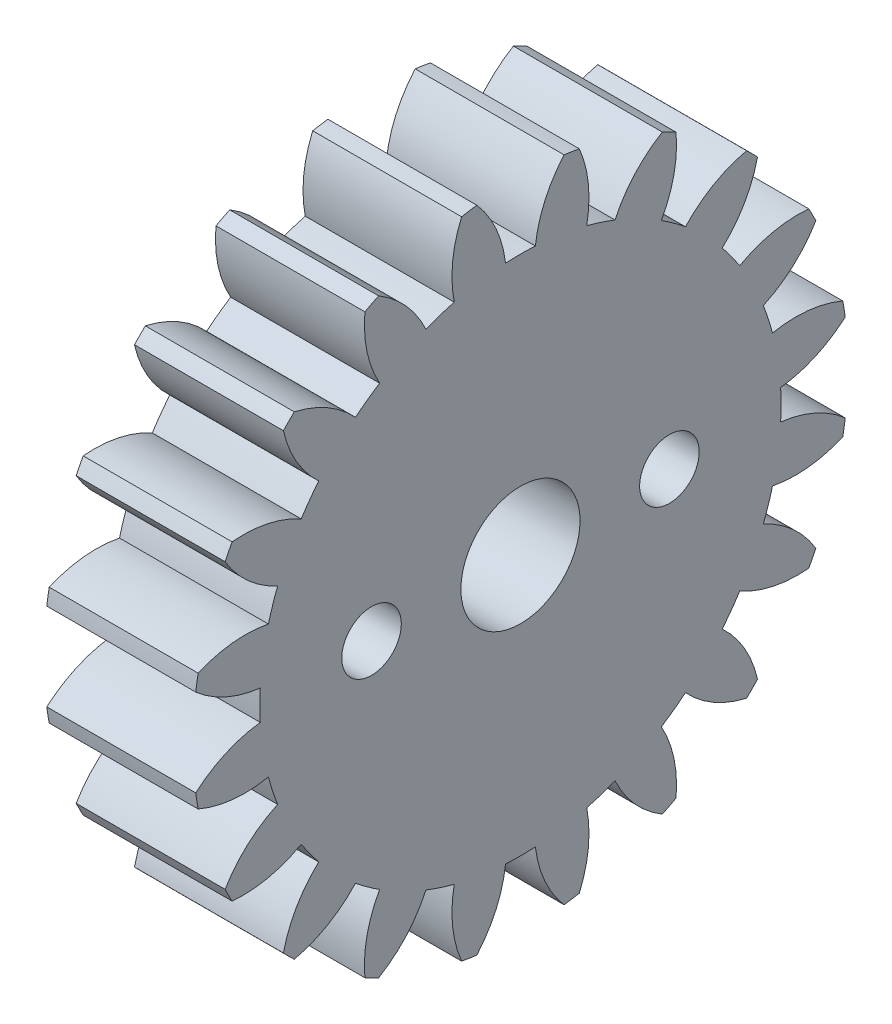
ISO-10303-21;
HEADER;
FILE_DESCRIPTION(('STEP AP214'),'2;1');
FILE_NAME('part.step','',(''),(''),'','','');
FILE_SCHEMA(('AUTOMOTIVE_DESIGN { 1 0 10303 214 1 1 1 1 }'));
ENDSEC;
DATA;
#1=APPLICATION_CONTEXT('core data for automotive mechanical design processes');
#2=APPLICATION_PROTOCOL_DEFINITION('international standard','automotive_design',2000,#1);
#3=PRODUCT_CONTEXT('',#1,'mechanical');
#4=PRODUCT('Part','Part','',(#3));
#5=PRODUCT_RELATED_PRODUCT_CATEGORY('part','',(#4));
#6=PRODUCT_DEFINITION_FORMATION('','',#4);
#7=PRODUCT_DEFINITION_CONTEXT('part definition',#1,'design');
#8=PRODUCT_DEFINITION('design','',#6,#7);
#9=PRODUCT_DEFINITION_SHAPE('','',#8);
#10=(LENGTH_UNIT() NAMED_UNIT(*) SI_UNIT(.MILLI.,.METRE.));
#11=(NAMED_UNIT(*) PLANE_ANGLE_UNIT() SI_UNIT($,.RADIAN.));
#12=(NAMED_UNIT(*) SI_UNIT($,.STERADIAN.) SOLID_ANGLE_UNIT());
#13=UNCERTAINTY_MEASURE_WITH_UNIT(LENGTH_MEASURE(1.E-05),#10,'distance_accuracy_value','');
#14=(GEOMETRIC_REPRESENTATION_CONTEXT(3) GLOBAL_UNCERTAINTY_ASSIGNED_CONTEXT((#13)) GLOBAL_UNIT_ASSIGNED_CONTEXT((#10,
#11,#12)) REPRESENTATION_CONTEXT('',''));
#15=CARTESIAN_POINT('',(0.,0.,0.));
#16=DIRECTION('',(0.,0.,1.));
#17=DIRECTION('',(1.,0.,0.));
#18=AXIS2_PLACEMENT_3D('',#15,#16,#17);
#19=CARTESIAN_POINT('',(-5.73931620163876,26.2995963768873,-47.0597371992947));
#20=DIRECTION('',(-1.,0.,0.));
#21=DIRECTION('',(0.,0.,1.));
#22=AXIS2_PLACEMENT_3D('',#19,#20,#21);
#23=PLANE('',#22);
#24=CARTESIAN_POINT('',(-5.73931620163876,26.2995963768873,-42.0597371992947));
#25=DIRECTION('',(1.,0.,0.));
#26=DIRECTION('',(0.,0.,-1.));
#27=AXIS2_PLACEMENT_3D('',#24,#25,#26);
#28=CIRCLE('',#27,0.999999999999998);
#29=CARTESIAN_POINT('',(-5.73931620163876,26.2995963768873,-43.0597371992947));
#30=VERTEX_POINT('',#29);
#31=EDGE_CURVE('E1182',#30,#30,#28,.T.);
#32=ORIENTED_EDGE('',*,*,#31,.F.);
#33=EDGE_LOOP('',(#32));
#34=FACE_BOUND('',#33,.T.);
#35=CARTESIAN_POINT('',(-5.73931620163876,26.2995963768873,-52.0597371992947));
#36=DIRECTION('',(1.,0.,0.));
#37=DIRECTION('',(0.,0.,-1.));
#38=AXIS2_PLACEMENT_3D('',#35,#36,#37);
#39=CIRCLE('',#38,0.999999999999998);
#40=CARTESIAN_POINT('',(-5.73931620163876,26.2995963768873,-53.0597371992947));
#41=VERTEX_POINT('',#40);
#42=EDGE_CURVE('E1185',#41,#41,#39,.T.);
#43=ORIENTED_EDGE('',*,*,#42,.F.);
#44=EDGE_LOOP('',(#43));
#45=FACE_BOUND('',#44,.T.);
#46=CARTESIAN_POINT('',(-5.73931620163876,32.7776077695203,-53.8669091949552));
#47=DIRECTION('',(-1.,0.,0.));
#48=DIRECTION('',(0.,-0.309016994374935,-0.951056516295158));
#49=AXIS2_PLACEMENT_3D('',#46,#47,#48);
#50=CIRCLE('',#49,4.);
#51=CARTESIAN_POINT('',(-5.73931620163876,34.4523097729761,-50.2343655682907));
#52=VERTEX_POINT('',#51);
#53=CARTESIAN_POINT('',(-5.73931620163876,36.2153311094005,-51.8219010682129));
#54=VERTEX_POINT('',#53);
#55=EDGE_CURVE('E541',#52,#54,#50,.T.);
#56=ORIENTED_EDGE('',*,*,#55,.F.);
#57=CARTESIAN_POINT('',(-5.73931620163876,26.2995963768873,-47.0597371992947));
#58=DIRECTION('',(-1.,0.,0.));
#59=DIRECTION('',(0.,-0.309016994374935,-0.951056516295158));
#60=AXIS2_PLACEMENT_3D('',#57,#58,#59);
#61=CIRCLE('',#60,8.749);
#62=CARTESIAN_POINT('',(-5.73931620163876,34.7612798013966,-49.2834535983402));
#63=VERTEX_POINT('',#62);
#64=EDGE_CURVE('E540',#63,#52,#61,.T.);
#65=ORIENTED_EDGE('',*,*,#64,.F.);
#66=CARTESIAN_POINT('',(-5.73931620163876,35.5415729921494,-45.3602989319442));
#67=DIRECTION('',(-1.,0.,0.));
#68=DIRECTION('',(0.,-0.309016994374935,-0.951056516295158));
#69=AXIS2_PLACEMENT_3D('',#66,#67,#68);
#70=CIRCLE('',#69,4.);
#71=CARTESIAN_POINT('',(-5.73931620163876,37.1207239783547,-49.0353883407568));
#72=VERTEX_POINT('',#71);
#73=EDGE_CURVE('E529',#72,#63,#70,.T.);
#74=ORIENTED_EDGE('',*,*,#73,.F.);
#75=CARTESIAN_POINT('',(-5.73931620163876,26.2995963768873,-47.0597371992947));
#76=DIRECTION('',(-1.,0.,0.));
#77=DIRECTION('',(0.,0.,1.));
#78=AXIS2_PLACEMENT_3D('',#75,#76,#77);
#79=CIRCLE('',#78,11.);
#80=CARTESIAN_POINT('',(-5.73931620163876,37.2016100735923,-48.5246936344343));
#81=VERTEX_POINT('',#80);
#82=EDGE_CURVE('E984',#81,#72,#79,.T.);
#83=ORIENTED_EDGE('',*,*,#82,.F.);
#84=CARTESIAN_POINT('',(-5.73931620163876,34.5640831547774,-51.5319268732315));
#85=DIRECTION('',(-1.,0.,0.));
#86=DIRECTION('',(0.,0.,-1.));
#87=AXIS2_PLACEMENT_3D('',#84,#85,#86);
#88=CIRCLE('',#87,4.);
#89=CARTESIAN_POINT('',(-5.73931620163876,35.0343016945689,-47.5596612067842));
#90=VERTEX_POINT('',#89);
#91=EDGE_CURVE('E957',#90,#81,#88,.T.);
#92=ORIENTED_EDGE('',*,*,#91,.F.);
#93=CARTESIAN_POINT('',(-5.73931620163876,26.2995963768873,-47.0597371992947));
#94=DIRECTION('',(-1.,0.,0.));
#95=DIRECTION('',(0.,0.,-1.));
#96=AXIS2_PLACEMENT_3D('',#93,#94,#95);
#97=CIRCLE('',#96,8.749);
#98=CARTESIAN_POINT('',(-5.73931620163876,35.0343016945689,-46.5598131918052));
#99=VERTEX_POINT('',#98);
#100=EDGE_CURVE('E962',#99,#90,#97,.T.);
#101=ORIENTED_EDGE('',*,*,#100,.F.);
#102=CARTESIAN_POINT('',(-5.73931620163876,34.5640831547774,-42.5875475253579));
#103=DIRECTION('',(-1.,0.,0.));
#104=DIRECTION('',(0.,0.,-1.));
#105=AXIS2_PLACEMENT_3D('',#102,#103,#104);
#106=CIRCLE('',#105,4.);
#107=CARTESIAN_POINT('',(-5.73931620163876,37.2016100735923,-45.5947807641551));
#108=VERTEX_POINT('',#107);
#109=EDGE_CURVE('E959',#108,#99,#106,.T.);
#110=ORIENTED_EDGE('',*,*,#109,.F.);
#111=CARTESIAN_POINT('',(-5.73931620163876,37.1207239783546,-45.0840860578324));
#112=VERTEX_POINT('',#111);
#113=EDGE_CURVE('E982',#112,#108,#79,.T.);
#114=ORIENTED_EDGE('',*,*,#113,.F.);
#115=CARTESIAN_POINT('',(-5.73931620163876,35.5415729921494,-48.7591754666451));
#116=DIRECTION('',(-1.,0.,0.));
#117=DIRECTION('',(0.,0.309016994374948,-0.951056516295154));
#118=AXIS2_PLACEMENT_3D('',#115,#116,#117);
#119=CIRCLE('',#118,4.);
#120=CARTESIAN_POINT('',(-5.73931620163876,34.7612798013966,-44.8360208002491));
#121=VERTEX_POINT('',#120);
#122=EDGE_CURVE('E935',#121,#112,#119,.T.);
#123=ORIENTED_EDGE('',*,*,#122,.F.);
#124=CARTESIAN_POINT('',(-5.73931620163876,26.2995963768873,-47.0597371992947));
#125=DIRECTION('',(-1.,0.,0.));
#126=DIRECTION('',(0.,0.309016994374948,-0.951056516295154));
#127=AXIS2_PLACEMENT_3D('',#124,#125,#126);
#128=CIRCLE('',#127,8.749);
#129=CARTESIAN_POINT('',(-5.73931620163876,34.452309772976,-43.8851088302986));
#130=VERTEX_POINT('',#129);
#131=EDGE_CURVE('E940',#130,#121,#128,.T.);
#132=ORIENTED_EDGE('',*,*,#131,.F.);
#133=CARTESIAN_POINT('',(-5.73931620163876,32.7776077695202,-40.2525652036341));
#134=DIRECTION('',(-1.,0.,0.));
#135=DIRECTION('',(0.,0.309016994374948,-0.951056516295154));
#136=AXIS2_PLACEMENT_3D('',#133,#134,#135);
#137=CIRCLE('',#136,4.);
#138=CARTESIAN_POINT('',(-5.73931620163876,36.2153311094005,-42.2975733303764));
#139=VERTEX_POINT('',#138);
#140=EDGE_CURVE('E937',#139,#130,#137,.T.);
#141=ORIENTED_EDGE('',*,*,#140,.F.);
#142=CARTESIAN_POINT('',(-5.73931620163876,35.980590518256,-41.8368689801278));
#143=VERTEX_POINT('',#142);
#144=EDGE_CURVE('E1130',#143,#139,#79,.T.);
#145=ORIENTED_EDGE('',*,*,#144,.F.);
#146=CARTESIAN_POINT('',(-5.73931620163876,35.6143937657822,-45.8200712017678));
#147=DIRECTION('',(-1.,0.,0.));
#148=DIRECTION('',(0.,0.587785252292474,-0.809016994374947));
#149=AXIS2_PLACEMENT_3D('',#146,#147,#148);
#150=CIRCLE('',#149,4.);
#151=CARTESIAN_POINT('',(-5.73931620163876,33.6599693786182,-42.3300532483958));
#152=VERTEX_POINT('',#151);
#153=EDGE_CURVE('E913',#152,#143,#150,.T.);
#154=ORIENTED_EDGE('',*,*,#153,.F.);
#155=CARTESIAN_POINT('',(-5.73931620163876,26.2995963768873,-47.0597371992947));
#156=DIRECTION('',(-1.,0.,0.));
#157=DIRECTION('',(0.,0.587785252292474,-0.809016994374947));
#158=AXIS2_PLACEMENT_3D('',#155,#156,#157);
#159=CIRCLE('',#158,8.749);
#160=CARTESIAN_POINT('',(-5.73931620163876,33.0722734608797,-41.5211592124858));
#161=VERTEX_POINT('',#160);
#162=EDGE_CURVE('E918',#161,#152,#159,.T.);
#163=ORIENTED_EDGE('',*,*,#162,.F.);
#164=CARTESIAN_POINT('',(-5.73931620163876,30.3570194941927,-38.5839163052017));
#165=DIRECTION('',(-1.,0.,0.));
#166=DIRECTION('',(0.,0.587785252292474,-0.809016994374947));
#167=AXIS2_PLACEMENT_3D('',#164,#165,#166);
#168=CIRCLE('',#167,4.);
#169=CARTESIAN_POINT('',(-5.73931620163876,34.258430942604,-39.4665196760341));
#170=VERTEX_POINT('',#169);
#171=EDGE_CURVE('E915',#170,#161,#168,.T.);
#172=ORIENTED_EDGE('',*,*,#171,.F.);
#173=CARTESIAN_POINT('',(-5.73931620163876,33.8928139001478,-39.1009026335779));
#174=VERTEX_POINT('',#173);
#175=EDGE_CURVE('E1125',#174,#170,#79,.T.);
#176=ORIENTED_EDGE('',*,*,#175,.F.);
#177=CARTESIAN_POINT('',(-5.73931620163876,34.7754172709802,-43.0023140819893));
#178=DIRECTION('',(-1.,0.,0.));
#179=DIRECTION('',(0.,0.809016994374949,-0.587785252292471));
#180=AXIS2_PLACEMENT_3D('',#177,#178,#179);
#181=CIRCLE('',#180,4.);
#182=CARTESIAN_POINT('',(-5.73931620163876,31.8381743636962,-40.2870601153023));
#183=VERTEX_POINT('',#182);
#184=EDGE_CURVE('E891',#183,#174,#181,.T.);
#185=ORIENTED_EDGE('',*,*,#184,.F.);
#186=CARTESIAN_POINT('',(-5.73931620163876,26.2995963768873,-47.0597371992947));
#187=DIRECTION('',(-1.,0.,0.));
#188=DIRECTION('',(0.,0.809016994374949,-0.587785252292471));
#189=AXIS2_PLACEMENT_3D('',#186,#187,#188);
#190=CIRCLE('',#189,8.749);
#191=CARTESIAN_POINT('',(-5.73931620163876,31.0292803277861,-39.6993641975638));
#192=VERTEX_POINT('',#191);
#193=EDGE_CURVE('E896',#192,#183,#190,.T.);
#194=ORIENTED_EDGE('',*,*,#193,.F.);
#195=CARTESIAN_POINT('',(-5.73931620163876,27.5392623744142,-37.7449398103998));
#196=DIRECTION('',(-1.,0.,0.));
#197=DIRECTION('',(0.,0.809016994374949,-0.587785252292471));
#198=AXIS2_PLACEMENT_3D('',#195,#196,#197);
#199=CIRCLE('',#198,4.);
#200=CARTESIAN_POINT('',(-5.73931620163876,31.5224645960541,-37.3787430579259));
#201=VERTEX_POINT('',#200);
#202=EDGE_CURVE('E893',#201,#192,#199,.T.);
#203=ORIENTED_EDGE('',*,*,#202,.F.);
#204=CARTESIAN_POINT('',(-5.73931620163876,31.0617602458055,-37.1440024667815));
#205=VERTEX_POINT('',#204);
#206=EDGE_CURVE('E1120',#205,#201,#79,.T.);
#207=ORIENTED_EDGE('',*,*,#206,.F.);
#208=CARTESIAN_POINT('',(-5.73931620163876,33.1067683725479,-40.5817258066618));
#209=DIRECTION('',(-1.,0.,0.));
#210=DIRECTION('',(0.,0.951056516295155,-0.309016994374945));
#211=AXIS2_PLACEMENT_3D('',#208,#209,#210);
#212=CIRCLE('',#211,4.);
#213=CARTESIAN_POINT('',(-5.73931620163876,29.4742247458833,-38.9070238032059));
#214=VERTEX_POINT('',#213);
#215=EDGE_CURVE('E869',#214,#205,#212,.T.);
#216=ORIENTED_EDGE('',*,*,#215,.F.);
#217=CARTESIAN_POINT('',(-5.73931620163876,26.2995963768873,-47.0597371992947));
#218=DIRECTION('',(-1.,0.,0.));
#219=DIRECTION('',(0.,0.951056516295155,-0.309016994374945));
#220=AXIS2_PLACEMENT_3D('',#217,#218,#219);
#221=CIRCLE('',#220,8.749);
#222=CARTESIAN_POINT('',(-5.73931620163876,28.5233127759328,-38.5980537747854));
#223=VERTEX_POINT('',#222);
#224=EDGE_CURVE('E874',#223,#214,#221,.T.);
#225=ORIENTED_EDGE('',*,*,#224,.F.);
#226=CARTESIAN_POINT('',(-5.73931620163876,24.6001581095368,-37.8177605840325));
#227=DIRECTION('',(-1.,0.,0.));
#228=DIRECTION('',(0.,0.951056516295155,-0.309016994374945));
#229=AXIS2_PLACEMENT_3D('',#226,#227,#228);
#230=CIRCLE('',#229,4.);
#231=CARTESIAN_POINT('',(-5.73931620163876,28.2752475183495,-36.2386095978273));
#232=VERTEX_POINT('',#231);
#233=EDGE_CURVE('E871',#232,#223,#230,.T.);
#234=ORIENTED_EDGE('',*,*,#233,.F.);
#235=CARTESIAN_POINT('',(-5.73931620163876,27.7645528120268,-36.1577235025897));
#236=VERTEX_POINT('',#235);
#237=EDGE_CURVE('E1115',#236,#232,#79,.T.);
#238=ORIENTED_EDGE('',*,*,#237,.F.);
#239=CARTESIAN_POINT('',(-5.73931620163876,30.7717860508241,-38.7952504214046));
#240=DIRECTION('',(-1.,0.,0.));
#241=DIRECTION('',(0.,1.,0.));
#242=AXIS2_PLACEMENT_3D('',#239,#240,#241);
#243=CIRCLE('',#242,4.);
#244=CARTESIAN_POINT('',(-5.73931620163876,26.7995203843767,-38.3250318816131));
#245=VERTEX_POINT('',#244);
#246=EDGE_CURVE('E847',#245,#236,#243,.T.);
#247=ORIENTED_EDGE('',*,*,#246,.F.);
#248=CARTESIAN_POINT('',(-5.73931620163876,26.2995963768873,-47.0597371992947));
#249=DIRECTION('',(-1.,0.,0.));
#250=DIRECTION('',(0.,1.,0.));
#251=AXIS2_PLACEMENT_3D('',#248,#249,#250);
#252=CIRCLE('',#251,8.749);
#253=CARTESIAN_POINT('',(-5.73931620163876,25.7996723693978,-38.3250318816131));
#254=VERTEX_POINT('',#253);
#255=EDGE_CURVE('E852',#254,#245,#252,.T.);
#256=ORIENTED_EDGE('',*,*,#255,.F.);
#257=CARTESIAN_POINT('',(-5.73931620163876,21.8274067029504,-38.7952504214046));
#258=DIRECTION('',(-1.,0.,0.));
#259=DIRECTION('',(0.,1.,0.));
#260=AXIS2_PLACEMENT_3D('',#257,#258,#259);
#261=CIRCLE('',#260,4.);
#262=CARTESIAN_POINT('',(-5.73931620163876,24.8346399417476,-36.1577235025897));
#263=VERTEX_POINT('',#262);
#264=EDGE_CURVE('E849',#263,#254,#261,.T.);
#265=ORIENTED_EDGE('',*,*,#264,.F.);
#266=CARTESIAN_POINT('',(-5.73931620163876,24.323945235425,-36.2386095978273));
#267=VERTEX_POINT('',#266);
#268=EDGE_CURVE('E1110',#267,#263,#79,.T.);
#269=ORIENTED_EDGE('',*,*,#268,.F.);
#270=CARTESIAN_POINT('',(-5.73931620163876,27.9990346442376,-37.8177605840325));
#271=DIRECTION('',(-1.,0.,0.));
#272=DIRECTION('',(0.,0.951056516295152,0.309016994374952));
#273=AXIS2_PLACEMENT_3D('',#270,#271,#272);
#274=CIRCLE('',#273,4.);
#275=CARTESIAN_POINT('',(-5.73931620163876,24.0758799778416,-38.5980537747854));
#276=VERTEX_POINT('',#275);
#277=EDGE_CURVE('E825',#276,#267,#274,.T.);
#278=ORIENTED_EDGE('',*,*,#277,.F.);
#279=CARTESIAN_POINT('',(-5.73931620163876,26.2995963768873,-47.0597371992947));
#280=DIRECTION('',(-1.,0.,0.));
#281=DIRECTION('',(0.,0.951056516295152,0.309016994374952));
#282=AXIS2_PLACEMENT_3D('',#279,#280,#281);
#283=CIRCLE('',#282,8.749);
#284=CARTESIAN_POINT('',(-5.73931620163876,23.1249680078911,-38.9070238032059));
#285=VERTEX_POINT('',#284);
#286=EDGE_CURVE('E830',#285,#276,#283,.T.);
#287=ORIENTED_EDGE('',*,*,#286,.F.);
#288=CARTESIAN_POINT('',(-5.73931620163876,19.4924243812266,-40.5817258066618));
#289=DIRECTION('',(-1.,0.,0.));
#290=DIRECTION('',(0.,0.951056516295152,0.309016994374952));
#291=AXIS2_PLACEMENT_3D('',#288,#289,#290);
#292=CIRCLE('',#291,4.);
#293=CARTESIAN_POINT('',(-5.73931620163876,21.5374325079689,-37.1440024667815));
#294=VERTEX_POINT('',#293);
#295=EDGE_CURVE('E827',#294,#285,#292,.T.);
#296=ORIENTED_EDGE('',*,*,#295,.F.);
#297=CARTESIAN_POINT('',(-5.73931620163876,21.0767281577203,-37.3787430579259));
#298=VERTEX_POINT('',#297);
#299=EDGE_CURVE('E1105',#298,#294,#79,.T.);
#300=ORIENTED_EDGE('',*,*,#299,.F.);
#301=CARTESIAN_POINT('',(-5.73931620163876,25.0599303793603,-37.7449398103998));
#302=DIRECTION('',(-1.,0.,0.));
#303=DIRECTION('',(0.,0.809016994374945,0.587785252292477));
#304=AXIS2_PLACEMENT_3D('',#301,#302,#303);
#305=CIRCLE('',#304,4.);
#306=CARTESIAN_POINT('',(-5.73931620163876,21.5699124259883,-39.6993641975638));
#307=VERTEX_POINT('',#306);
#308=EDGE_CURVE('E803',#307,#298,#305,.T.);
#309=ORIENTED_EDGE('',*,*,#308,.F.);
#310=CARTESIAN_POINT('',(-5.73931620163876,26.2995963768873,-47.0597371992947));
#311=DIRECTION('',(-1.,0.,0.));
#312=DIRECTION('',(0.,0.809016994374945,0.587785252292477));
#313=AXIS2_PLACEMENT_3D('',#310,#311,#312);
#314=CIRCLE('',#313,8.749);
#315=CARTESIAN_POINT('',(-5.73931620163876,20.7610183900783,-40.2870601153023));
#316=VERTEX_POINT('',#315);
#317=EDGE_CURVE('E808',#316,#307,#314,.T.);
#318=ORIENTED_EDGE('',*,*,#317,.F.);
#319=CARTESIAN_POINT('',(-5.73931620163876,17.8237754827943,-43.0023140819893));
#320=DIRECTION('',(-1.,0.,0.));
#321=DIRECTION('',(0.,0.809016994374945,0.587785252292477));
#322=AXIS2_PLACEMENT_3D('',#319,#320,#321);
#323=CIRCLE('',#322,4.);
#324=CARTESIAN_POINT('',(-5.73931620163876,18.7063788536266,-39.100902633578));
#325=VERTEX_POINT('',#324);
#326=EDGE_CURVE('E805',#325,#316,#323,.T.);
#327=ORIENTED_EDGE('',*,*,#326,.F.);
#328=CARTESIAN_POINT('',(-5.73931620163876,18.3407618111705,-39.4665196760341));
#329=VERTEX_POINT('',#328);
#330=EDGE_CURVE('E1100',#329,#325,#79,.T.);
#331=ORIENTED_EDGE('',*,*,#330,.F.);
#332=CARTESIAN_POINT('',(-5.73931620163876,22.2421732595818,-38.5839163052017));
#333=DIRECTION('',(-1.,0.,0.));
#334=DIRECTION('',(0.,0.587785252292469,0.809016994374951));
#335=AXIS2_PLACEMENT_3D('',#332,#333,#334);
#336=CIRCLE('',#335,4.);
#337=CARTESIAN_POINT('',(-5.73931620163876,19.5269192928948,-41.5211592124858));
#338=VERTEX_POINT('',#337);
#339=EDGE_CURVE('E781',#338,#329,#336,.T.);
#340=ORIENTED_EDGE('',*,*,#339,.F.);
#341=CARTESIAN_POINT('',(-5.73931620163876,26.2995963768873,-47.0597371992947));
#342=DIRECTION('',(-1.,0.,0.));
#343=DIRECTION('',(0.,0.587785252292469,0.809016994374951));
#344=AXIS2_PLACEMENT_3D('',#341,#342,#343);
#345=CIRCLE('',#344,8.749);
#346=CARTESIAN_POINT('',(-5.73931620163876,18.9392233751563,-42.3300532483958));
#347=VERTEX_POINT('',#346);
#348=EDGE_CURVE('E786',#347,#338,#345,.T.);
#349=ORIENTED_EDGE('',*,*,#348,.F.);
#350=CARTESIAN_POINT('',(-5.73931620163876,16.9847989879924,-45.8200712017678));
#351=DIRECTION('',(-1.,0.,0.));
#352=DIRECTION('',(0.,0.587785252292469,0.809016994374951));
#353=AXIS2_PLACEMENT_3D('',#350,#351,#352);
#354=CIRCLE('',#353,4.);
#355=CARTESIAN_POINT('',(-5.73931620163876,16.6186022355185,-41.8368689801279));
#356=VERTEX_POINT('',#355);
#357=EDGE_CURVE('E783',#356,#347,#354,.T.);
#358=ORIENTED_EDGE('',*,*,#357,.F.);
#359=CARTESIAN_POINT('',(-5.73931620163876,16.383861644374,-42.2975733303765));
#360=VERTEX_POINT('',#359);
#361=EDGE_CURVE('E1095',#360,#356,#79,.T.);
#362=ORIENTED_EDGE('',*,*,#361,.F.);
#363=CARTESIAN_POINT('',(-5.73931620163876,19.8215849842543,-40.2525652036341));
#364=DIRECTION('',(-1.,0.,0.));
#365=DIRECTION('',(0.,0.309016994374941,0.951056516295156));
#366=AXIS2_PLACEMENT_3D('',#363,#364,#365);
#367=CIRCLE('',#366,4.);
#368=CARTESIAN_POINT('',(-5.73931620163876,18.1468829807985,-43.8851088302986));
#369=VERTEX_POINT('',#368);
#370=EDGE_CURVE('E759',#369,#360,#367,.T.);
#371=ORIENTED_EDGE('',*,*,#370,.F.);
#372=CARTESIAN_POINT('',(-5.73931620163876,26.2995963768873,-47.0597371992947));
#373=DIRECTION('',(-1.,0.,0.));
#374=DIRECTION('',(0.,0.309016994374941,0.951056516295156));
#375=AXIS2_PLACEMENT_3D('',#372,#373,#374);
#376=CIRCLE('',#375,8.749);
#377=CARTESIAN_POINT('',(-5.73931620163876,17.8379129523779,-44.8360208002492));
#378=VERTEX_POINT('',#377);
#379=EDGE_CURVE('E764',#378,#369,#376,.T.);
#380=ORIENTED_EDGE('',*,*,#379,.F.);
#381=CARTESIAN_POINT('',(-5.73931620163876,17.0576197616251,-48.7591754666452));
#382=DIRECTION('',(-1.,0.,0.));
#383=DIRECTION('',(0.,0.309016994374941,0.951056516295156));
#384=AXIS2_PLACEMENT_3D('',#381,#382,#383);
#385=CIRCLE('',#384,4.);
#386=CARTESIAN_POINT('',(-5.73931620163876,15.4784687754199,-45.0840860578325));
#387=VERTEX_POINT('',#386);
#388=EDGE_CURVE('E761',#387,#378,#385,.T.);
#389=ORIENTED_EDGE('',*,*,#388,.F.);
#390=CARTESIAN_POINT('',(-5.73931620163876,15.3975826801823,-45.5947807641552));
#391=VERTEX_POINT('',#390);
#392=EDGE_CURVE('E1090',#391,#387,#79,.T.);
#393=ORIENTED_EDGE('',*,*,#392,.F.);
#394=CARTESIAN_POINT('',(-5.73931620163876,18.0351095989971,-42.5875475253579));
#395=DIRECTION('',(-1.,0.,0.));
#396=DIRECTION('',(0.,0.,1.));
#397=AXIS2_PLACEMENT_3D('',#394,#395,#396);
#398=CIRCLE('',#397,4.);
#399=CARTESIAN_POINT('',(-5.73931620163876,17.5648910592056,-46.5598131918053));
#400=VERTEX_POINT('',#399);
#401=EDGE_CURVE('E737',#400,#391,#398,.T.);
#402=ORIENTED_EDGE('',*,*,#401,.F.);
#403=CARTESIAN_POINT('',(-5.73931620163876,26.2995963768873,-47.0597371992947));
#404=DIRECTION('',(-1.,0.,0.));
#405=DIRECTION('',(0.,0.,1.));
#406=AXIS2_PLACEMENT_3D('',#403,#404,#405);
#407=CIRCLE('',#406,8.749);
#408=CARTESIAN_POINT('',(-5.73931620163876,17.5648910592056,-47.5596612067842));
#409=VERTEX_POINT('',#408);
#410=EDGE_CURVE('E742',#409,#400,#407,.T.);
#411=ORIENTED_EDGE('',*,*,#410,.F.);
#412=CARTESIAN_POINT('',(-5.73931620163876,18.0351095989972,-51.5319268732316));
#413=DIRECTION('',(-1.,0.,0.));
#414=DIRECTION('',(0.,0.,1.));
#415=AXIS2_PLACEMENT_3D('',#412,#413,#414);
#416=CIRCLE('',#415,4.);
#417=CARTESIAN_POINT('',(-5.73931620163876,15.3975826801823,-48.5246936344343));
#418=VERTEX_POINT('',#417);
#419=EDGE_CURVE('E739',#418,#409,#416,.T.);
#420=ORIENTED_EDGE('',*,*,#419,.F.);
#421=CARTESIAN_POINT('',(-5.73931620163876,15.4784687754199,-49.035388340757));
#422=VERTEX_POINT('',#421);
#423=EDGE_CURVE('E1085',#422,#418,#79,.T.);
#424=ORIENTED_EDGE('',*,*,#423,.F.);
#425=CARTESIAN_POINT('',(-5.73931620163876,17.0576197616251,-45.3602989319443));
#426=DIRECTION('',(-1.,0.,0.));
#427=DIRECTION('',(0.,-0.309016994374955,0.951056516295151));
#428=AXIS2_PLACEMENT_3D('',#425,#426,#427);
#429=CIRCLE('',#428,4.);
#430=CARTESIAN_POINT('',(-5.73931620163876,17.837912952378,-49.2834535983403));
#431=VERTEX_POINT('',#430);
#432=EDGE_CURVE('E715',#431,#422,#429,.T.);
#433=ORIENTED_EDGE('',*,*,#432,.F.);
#434=CARTESIAN_POINT('',(-5.73931620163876,26.2995963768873,-47.0597371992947));
#435=DIRECTION('',(-1.,0.,0.));
#436=DIRECTION('',(0.,-0.309016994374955,0.951056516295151));
#437=AXIS2_PLACEMENT_3D('',#434,#435,#436);
#438=CIRCLE('',#437,8.749);
#439=CARTESIAN_POINT('',(-5.73931620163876,18.1468829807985,-50.2343655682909));
#440=VERTEX_POINT('',#439);
#441=EDGE_CURVE('E720',#440,#431,#438,.T.);
#442=ORIENTED_EDGE('',*,*,#441,.F.);
#443=CARTESIAN_POINT('',(-5.73931620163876,19.8215849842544,-53.8669091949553));
#444=DIRECTION('',(-1.,0.,0.));
#445=DIRECTION('',(0.,-0.309016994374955,0.951056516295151));
#446=AXIS2_PLACEMENT_3D('',#443,#444,#445);
#447=CIRCLE('',#446,4.);
#448=CARTESIAN_POINT('',(-5.73931620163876,16.3838616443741,-51.8219010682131));
#449=VERTEX_POINT('',#448);
#450=EDGE_CURVE('E717',#449,#440,#447,.T.);
#451=ORIENTED_EDGE('',*,*,#450,.F.);
#452=CARTESIAN_POINT('',(-5.73931620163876,16.6186022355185,-52.2826054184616));
#453=VERTEX_POINT('',#452);
#454=EDGE_CURVE('E1080',#453,#449,#79,.T.);
#455=ORIENTED_EDGE('',*,*,#454,.F.);
#456=CARTESIAN_POINT('',(-5.73931620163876,16.9847989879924,-48.2994031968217));
#457=DIRECTION('',(-1.,0.,0.));
#458=DIRECTION('',(0.,-0.58778525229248,0.809016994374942));
#459=AXIS2_PLACEMENT_3D('',#456,#457,#458);
#460=CIRCLE('',#459,4.);
#461=CARTESIAN_POINT('',(-5.73931620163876,18.9392233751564,-51.7894211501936));
#462=VERTEX_POINT('',#461);
#463=EDGE_CURVE('E693',#462,#453,#460,.T.);
#464=ORIENTED_EDGE('',*,*,#463,.F.);
#465=CARTESIAN_POINT('',(-5.73931620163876,26.2995963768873,-47.0597371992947));
#466=DIRECTION('',(-1.,0.,0.));
#467=DIRECTION('',(0.,-0.58778525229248,0.809016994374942));
#468=AXIS2_PLACEMENT_3D('',#465,#466,#467);
#469=CIRCLE('',#468,8.749);
#470=CARTESIAN_POINT('',(-5.73931620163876,19.5269192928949,-52.5983151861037));
#471=VERTEX_POINT('',#470);
#472=EDGE_CURVE('E698',#471,#462,#469,.T.);
#473=ORIENTED_EDGE('',*,*,#472,.F.);
#474=CARTESIAN_POINT('',(-5.73931620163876,22.2421732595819,-55.5355580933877));
#475=DIRECTION('',(-1.,0.,0.));
#476=DIRECTION('',(0.,-0.58778525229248,0.809016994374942));
#477=AXIS2_PLACEMENT_3D('',#474,#475,#476);
#478=CIRCLE('',#477,4.);
#479=CARTESIAN_POINT('',(-5.73931620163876,18.3407618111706,-54.6529547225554));
#480=VERTEX_POINT('',#479);
#481=EDGE_CURVE('E695',#480,#471,#478,.T.);
#482=ORIENTED_EDGE('',*,*,#481,.F.);
#483=CARTESIAN_POINT('',(-5.73931620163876,18.7063788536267,-55.0185717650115));
#484=VERTEX_POINT('',#483);
#485=EDGE_CURVE('E1075',#484,#480,#79,.T.);
#486=ORIENTED_EDGE('',*,*,#485,.F.);
#487=CARTESIAN_POINT('',(-5.73931620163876,17.8237754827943,-51.1171603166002));
#488=DIRECTION('',(-1.,0.,0.));
#489=DIRECTION('',(0.,-0.809016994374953,0.587785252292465));
#490=AXIS2_PLACEMENT_3D('',#487,#488,#489);
#491=CIRCLE('',#490,4.);
#492=CARTESIAN_POINT('',(-5.73931620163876,20.7610183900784,-53.8324142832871));
#493=VERTEX_POINT('',#492);
#494=EDGE_CURVE('E671',#493,#484,#491,.T.);
#495=ORIENTED_EDGE('',*,*,#494,.F.);
#496=CARTESIAN_POINT('',(-5.73931620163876,26.2995963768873,-47.0597371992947));
#497=DIRECTION('',(-1.,0.,0.));
#498=DIRECTION('',(0.,-0.809016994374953,0.587785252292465));
#499=AXIS2_PLACEMENT_3D('',#496,#497,#498);
#500=CIRCLE('',#499,8.749);
#501=CARTESIAN_POINT('',(-5.73931620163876,21.5699124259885,-54.4201102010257));
#502=VERTEX_POINT('',#501);
#503=EDGE_CURVE('E676',#502,#493,#500,.T.);
#504=ORIENTED_EDGE('',*,*,#503,.F.);
#505=CARTESIAN_POINT('',(-5.73931620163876,25.0599303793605,-56.3745345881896));
#506=DIRECTION('',(-1.,0.,0.));
#507=DIRECTION('',(0.,-0.809016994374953,0.587785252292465));
#508=AXIS2_PLACEMENT_3D('',#505,#506,#507);
#509=CIRCLE('',#508,4.);
#510=CARTESIAN_POINT('',(-5.73931620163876,21.0767281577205,-56.7407313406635));
#511=VERTEX_POINT('',#510);
#512=EDGE_CURVE('E673',#511,#502,#509,.T.);
#513=ORIENTED_EDGE('',*,*,#512,.F.);
#514=CARTESIAN_POINT('',(-5.73931620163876,21.5374325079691,-56.975471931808));
#515=VERTEX_POINT('',#514);
#516=EDGE_CURVE('E1070',#515,#511,#79,.T.);
#517=ORIENTED_EDGE('',*,*,#516,.F.);
#518=CARTESIAN_POINT('',(-5.73931620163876,19.4924243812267,-53.5377485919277));
#519=DIRECTION('',(-1.,0.,0.));
#520=DIRECTION('',(0.,-0.951056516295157,0.309016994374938));
#521=AXIS2_PLACEMENT_3D('',#518,#519,#520);
#522=CIRCLE('',#521,4.);
#523=CARTESIAN_POINT('',(-5.73931620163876,23.1249680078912,-55.2124505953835));
#524=VERTEX_POINT('',#523);
#525=EDGE_CURVE('E649',#524,#515,#522,.T.);
#526=ORIENTED_EDGE('',*,*,#525,.F.);
#527=CARTESIAN_POINT('',(-5.73931620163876,26.2995963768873,-47.0597371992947));
#528=DIRECTION('',(-1.,0.,0.));
#529=DIRECTION('',(0.,-0.951056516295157,0.309016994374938));
#530=AXIS2_PLACEMENT_3D('',#527,#528,#529);
#531=CIRCLE('',#530,8.749);
#532=CARTESIAN_POINT('',(-5.73931620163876,24.0758799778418,-55.521420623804));
#533=VERTEX_POINT('',#532);
#534=EDGE_CURVE('E654',#533,#524,#531,.T.);
#535=ORIENTED_EDGE('',*,*,#534,.F.);
#536=CARTESIAN_POINT('',(-5.73931620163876,27.9990346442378,-56.3017138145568));
#537=DIRECTION('',(-1.,0.,0.));
#538=DIRECTION('',(0.,-0.951056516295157,0.309016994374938));
#539=AXIS2_PLACEMENT_3D('',#536,#537,#538);
#540=CIRCLE('',#539,4.);
#541=CARTESIAN_POINT('',(-5.73931620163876,24.3239452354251,-57.8808648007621));
#542=VERTEX_POINT('',#541);
#543=EDGE_CURVE('E651',#542,#533,#540,.T.);
#544=ORIENTED_EDGE('',*,*,#543,.F.);
#545=CARTESIAN_POINT('',(-5.73931620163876,24.8346399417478,-57.9617508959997));
#546=VERTEX_POINT('',#545);
#547=EDGE_CURVE('E1065',#546,#542,#79,.T.);
#548=ORIENTED_EDGE('',*,*,#547,.F.);
#549=CARTESIAN_POINT('',(-5.73931620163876,21.8274067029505,-55.3242239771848));
#550=DIRECTION('',(-1.,0.,0.));
#551=DIRECTION('',(0.,-1.,0.));
#552=AXIS2_PLACEMENT_3D('',#549,#550,#551);
#553=CIRCLE('',#552,4.);
#554=CARTESIAN_POINT('',(-5.73931620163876,25.7996723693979,-55.7944425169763));
#555=VERTEX_POINT('',#554);
#556=EDGE_CURVE('E627',#555,#546,#553,.T.);
#557=ORIENTED_EDGE('',*,*,#556,.F.);
#558=CARTESIAN_POINT('',(-5.73931620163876,26.2995963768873,-47.0597371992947));
#559=DIRECTION('',(-1.,0.,0.));
#560=DIRECTION('',(0.,-1.,0.));
#561=AXIS2_PLACEMENT_3D('',#558,#559,#560);
#562=CIRCLE('',#561,8.749);
#563=CARTESIAN_POINT('',(-5.73931620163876,26.7995203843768,-55.7944425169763));
#564=VERTEX_POINT('',#563);
#565=EDGE_CURVE('E632',#564,#555,#562,.T.);
#566=ORIENTED_EDGE('',*,*,#565,.F.);
#567=CARTESIAN_POINT('',(-5.73931620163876,30.7717860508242,-55.3242239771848));
#568=DIRECTION('',(-1.,0.,0.));
#569=DIRECTION('',(0.,-1.,0.));
#570=AXIS2_PLACEMENT_3D('',#567,#568,#569);
#571=CIRCLE('',#570,4.);
#572=CARTESIAN_POINT('',(-5.73931620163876,27.764552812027,-57.9617508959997));
#573=VERTEX_POINT('',#572);
#574=EDGE_CURVE('E629',#573,#564,#571,.T.);
#575=ORIENTED_EDGE('',*,*,#574,.F.);
#576=CARTESIAN_POINT('',(-5.73931620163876,28.2752475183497,-57.880864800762));
#577=VERTEX_POINT('',#576);
#578=EDGE_CURVE('E1060',#577,#573,#79,.T.);
#579=ORIENTED_EDGE('',*,*,#578,.F.);
#580=CARTESIAN_POINT('',(-5.73931620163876,24.600158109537,-56.3017138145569));
#581=DIRECTION('',(-1.,0.,0.));
#582=DIRECTION('',(0.,-0.95105651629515,-0.309016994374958));
#583=AXIS2_PLACEMENT_3D('',#580,#581,#582);
#584=CIRCLE('',#583,4.);
#585=CARTESIAN_POINT('',(-5.73931620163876,28.523312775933,-55.521420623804));
#586=VERTEX_POINT('',#585);
#587=EDGE_CURVE('E605',#586,#577,#584,.T.);
#588=ORIENTED_EDGE('',*,*,#587,.F.);
#589=CARTESIAN_POINT('',(-5.73931620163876,26.2995963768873,-47.0597371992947));
#590=DIRECTION('',(-1.,0.,0.));
#591=DIRECTION('',(0.,-0.95105651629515,-0.309016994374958));
#592=AXIS2_PLACEMENT_3D('',#589,#590,#591);
#593=CIRCLE('',#592,8.749);
#594=CARTESIAN_POINT('',(-5.73931620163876,29.4742247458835,-55.2124505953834));
#595=VERTEX_POINT('',#594);
#596=EDGE_CURVE('E610',#595,#586,#593,.T.);
#597=ORIENTED_EDGE('',*,*,#596,.F.);
#598=CARTESIAN_POINT('',(-5.73931620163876,33.1067683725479,-53.5377485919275));
#599=DIRECTION('',(-1.,0.,0.));
#600=DIRECTION('',(0.,-0.95105651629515,-0.309016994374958));
#601=AXIS2_PLACEMENT_3D('',#598,#599,#600);
#602=CIRCLE('',#601,4.);
#603=CARTESIAN_POINT('',(-5.73931620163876,31.0617602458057,-56.9754719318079));
#604=VERTEX_POINT('',#603);
#605=EDGE_CURVE('E607',#604,#595,#602,.T.);
#606=ORIENTED_EDGE('',*,*,#605,.F.);
#607=CARTESIAN_POINT('',(-5.73931620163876,31.5224645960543,-56.7407313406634));
#608=VERTEX_POINT('',#607);
#609=EDGE_CURVE('E1055',#608,#604,#79,.T.);
#610=ORIENTED_EDGE('',*,*,#609,.F.);
#611=CARTESIAN_POINT('',(-5.73931620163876,27.5392623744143,-56.3745345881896));
#612=DIRECTION('',(-1.,0.,0.));
#613=DIRECTION('',(0.,-0.80901699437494,-0.587785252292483));
#614=AXIS2_PLACEMENT_3D('',#611,#612,#613);
#615=CIRCLE('',#614,4.);
#616=CARTESIAN_POINT('',(-5.73931620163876,31.0292803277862,-54.4201102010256));
#617=VERTEX_POINT('',#616);
#618=EDGE_CURVE('E583',#617,#608,#615,.T.);
#619=ORIENTED_EDGE('',*,*,#618,.F.);
#620=CARTESIAN_POINT('',(-5.73931620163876,26.2995963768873,-47.0597371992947));
#621=DIRECTION('',(-1.,0.,0.));
#622=DIRECTION('',(0.,-0.80901699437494,-0.587785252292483));
#623=AXIS2_PLACEMENT_3D('',#620,#621,#622);
#624=CIRCLE('',#623,8.749);
#625=CARTESIAN_POINT('',(-5.73931620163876,31.8381743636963,-53.832414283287));
#626=VERTEX_POINT('',#625);
#627=EDGE_CURVE('E588',#626,#617,#624,.T.);
#628=ORIENTED_EDGE('',*,*,#627,.F.);
#629=CARTESIAN_POINT('',(-5.73931620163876,34.7754172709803,-51.1171603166));
#630=DIRECTION('',(-1.,0.,0.));
#631=DIRECTION('',(0.,-0.80901699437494,-0.587785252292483));
#632=AXIS2_PLACEMENT_3D('',#629,#630,#631);
#633=CIRCLE('',#632,4.);
#634=CARTESIAN_POINT('',(-5.73931620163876,33.892813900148,-55.0185717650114));
#635=VERTEX_POINT('',#634);
#636=EDGE_CURVE('E585',#635,#626,#633,.T.);
#637=ORIENTED_EDGE('',*,*,#636,.F.);
#638=CARTESIAN_POINT('',(-5.73931620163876,34.2584309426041,-54.6529547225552));
#639=VERTEX_POINT('',#638);
#640=EDGE_CURVE('E1054',#639,#635,#79,.T.);
#641=ORIENTED_EDGE('',*,*,#640,.F.);
#642=CARTESIAN_POINT('',(-5.73931620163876,30.3570194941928,-55.5355580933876));
#643=DIRECTION('',(-1.,0.,0.));
#644=DIRECTION('',(0.,-0.587785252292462,-0.809016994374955));
#645=AXIS2_PLACEMENT_3D('',#642,#643,#644);
#646=CIRCLE('',#645,4.);
#647=CARTESIAN_POINT('',(-5.73931620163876,33.0722734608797,-52.5983151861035));
#648=VERTEX_POINT('',#647);
#649=EDGE_CURVE('E563',#648,#639,#646,.T.);
#650=ORIENTED_EDGE('',*,*,#649,.F.);
#651=CARTESIAN_POINT('',(-5.73931620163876,26.2995963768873,-47.0597371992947));
#652=DIRECTION('',(-1.,0.,0.));
#653=DIRECTION('',(0.,-0.587785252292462,-0.809016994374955));
#654=AXIS2_PLACEMENT_3D('',#651,#652,#653);
#655=CIRCLE('',#654,8.749);
#656=CARTESIAN_POINT('',(-5.73931620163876,33.6599693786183,-51.7894211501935));
#657=VERTEX_POINT('',#656);
#658=EDGE_CURVE('E568',#657,#648,#655,.T.);
#659=ORIENTED_EDGE('',*,*,#658,.F.);
#660=CARTESIAN_POINT('',(-5.73931620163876,35.6143937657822,-48.2994031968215));
#661=DIRECTION('',(-1.,0.,0.));
#662=DIRECTION('',(0.,-0.587785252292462,-0.809016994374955));
#663=AXIS2_PLACEMENT_3D('',#660,#661,#662);
#664=CIRCLE('',#663,4.);
#665=CARTESIAN_POINT('',(-5.73931620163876,35.9805905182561,-52.2826054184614));
#666=VERTEX_POINT('',#665);
#667=EDGE_CURVE('E565',#666,#657,#664,.T.);
#668=ORIENTED_EDGE('',*,*,#667,.F.);
#669=EDGE_CURVE('E987',#54,#666,#79,.T.);
#670=ORIENTED_EDGE('',*,*,#669,.F.);
#671=EDGE_LOOP('',(#56,#65,#74,#83,#92,#101,#110,#114,#123,#132,#141,#145,#154,#163,#172,#176,
#185,#194,#203,#207,#216,#225,#234,#238,#247,#256,#265,#269,#278,#287,#296,#300,#309,#318,#327,
#331,#340,#349,#358,#362,#371,#380,#389,#393,#402,#411,#420,#424,#433,#442,#451,#455,#464,#473,
#482,#486,#495,#504,#513,#517,#526,#535,#544,#548,#557,#566,#575,#579,#588,#597,#606,#610,#619,
#628,#637,#641,#650,#659,#668,#670));
#672=FACE_BOUND('',#671,.T.);
#673=CARTESIAN_POINT('',(-5.73931620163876,26.2995963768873,-47.0597371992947));
#674=DIRECTION('',(-1.,0.,0.));
#675=DIRECTION('',(0.,0.,1.));
#676=AXIS2_PLACEMENT_3D('',#673,#674,#675);
#677=CIRCLE('',#676,2.);
#678=CARTESIAN_POINT('',(-5.73931620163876,26.2995963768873,-45.0597371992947));
#679=VERTEX_POINT('',#678);
#680=EDGE_CURVE('E558',#679,#679,#677,.F.);
#681=ORIENTED_EDGE('',*,*,#680,.F.);
#682=EDGE_LOOP('',(#681));
#683=FACE_BOUND('',#682,.T.);
#684=ADVANCED_FACE('F32',(#34,#45,#672,#683),#23,.F.);
#685=CARTESIAN_POINT('',(-10.7393162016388,26.2995963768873,-47.0597371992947));
#686=DIRECTION('',(1.,0.,0.));
#687=DIRECTION('',(0.,0.,-1.));
#688=AXIS2_PLACEMENT_3D('',#685,#686,#687);
#689=PLANE('',#688);
#690=CARTESIAN_POINT('',(-10.7393162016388,26.2995963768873,-42.0597371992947));
#691=DIRECTION('',(1.,0.,0.));
#692=DIRECTION('',(0.,0.,-1.));
#693=AXIS2_PLACEMENT_3D('',#690,#691,#692);
#694=CIRCLE('',#693,0.999999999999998);
#695=CARTESIAN_POINT('',(-10.7393162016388,26.2995963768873,-43.0597371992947));
#696=VERTEX_POINT('',#695);
#697=EDGE_CURVE('E1188',#696,#696,#694,.T.);
#698=ORIENTED_EDGE('',*,*,#697,.T.);
#699=EDGE_LOOP('',(#698));
#700=FACE_BOUND('',#699,.T.);
#701=CARTESIAN_POINT('',(-10.7393162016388,26.2995963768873,-52.0597371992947));
#702=DIRECTION('',(1.,0.,0.));
#703=DIRECTION('',(0.,0.,-1.));
#704=AXIS2_PLACEMENT_3D('',#701,#702,#703);
#705=CIRCLE('',#704,0.999999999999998);
#706=CARTESIAN_POINT('',(-10.7393162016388,26.2995963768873,-53.0597371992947));
#707=VERTEX_POINT('',#706);
#708=EDGE_CURVE('E1187',#707,#707,#705,.T.);
#709=ORIENTED_EDGE('',*,*,#708,.T.);
#710=EDGE_LOOP('',(#709));
#711=FACE_BOUND('',#710,.T.);
#712=CARTESIAN_POINT('',(-10.7393162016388,32.7776077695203,-53.8669091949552));
#713=DIRECTION('',(-1.,0.,0.));
#714=DIRECTION('',(0.,-0.309016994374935,-0.951056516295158));
#715=AXIS2_PLACEMENT_3D('',#712,#713,#714);
#716=CIRCLE('',#715,4.);
#717=CARTESIAN_POINT('',(-10.7393162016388,34.4523097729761,-50.2343655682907));
#718=VERTEX_POINT('',#717);
#719=CARTESIAN_POINT('',(-10.7393162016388,36.2153311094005,-51.8219010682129));
#720=VERTEX_POINT('',#719);
#721=EDGE_CURVE('E47',#718,#720,#716,.T.);
#722=ORIENTED_EDGE('',*,*,#721,.T.);
#723=CARTESIAN_POINT('',(-10.7393162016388,26.2995963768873,-47.0597371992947));
#724=DIRECTION('',(-1.,0.,0.));
#725=DIRECTION('',(0.,0.,1.));
#726=AXIS2_PLACEMENT_3D('',#723,#724,#725);
#727=CIRCLE('',#726,11.);
#728=CARTESIAN_POINT('',(-10.7393162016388,35.9805905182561,-52.2826054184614));
#729=VERTEX_POINT('',#728);
#730=EDGE_CURVE('E983',#720,#729,#727,.T.);
#731=ORIENTED_EDGE('',*,*,#730,.T.);
#732=CARTESIAN_POINT('',(-10.7393162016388,35.6143937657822,-48.2994031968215));
#733=DIRECTION('',(1.,0.,0.));
#734=DIRECTION('',(0.,0.,-1.));
#735=AXIS2_PLACEMENT_3D('',#732,#733,#734);
#736=CIRCLE('',#735,4.);
#737=CARTESIAN_POINT('',(-10.7393162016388,33.6599693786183,-51.7894211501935));
#738=VERTEX_POINT('',#737);
#739=EDGE_CURVE('E40',#738,#729,#736,.T.);
#740=ORIENTED_EDGE('',*,*,#739,.F.);
#741=CARTESIAN_POINT('',(-10.7393162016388,26.2995963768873,-47.0597371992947));
#742=DIRECTION('',(-1.,0.,0.));
#743=DIRECTION('',(0.,-0.587785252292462,-0.809016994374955));
#744=AXIS2_PLACEMENT_3D('',#741,#742,#743);
#745=CIRCLE('',#744,8.749);
#746=CARTESIAN_POINT('',(-10.7393162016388,33.0722734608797,-52.5983151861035));
#747=VERTEX_POINT('',#746);
#748=EDGE_CURVE('E566',#738,#747,#745,.T.);
#749=ORIENTED_EDGE('',*,*,#748,.T.);
#750=CARTESIAN_POINT('',(-10.7393162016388,30.3570194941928,-55.5355580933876));
#751=DIRECTION('',(-1.,0.,0.));
#752=DIRECTION('',(0.,-0.587785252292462,-0.809016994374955));
#753=AXIS2_PLACEMENT_3D('',#750,#751,#752);
#754=CIRCLE('',#753,4.);
#755=CARTESIAN_POINT('',(-10.7393162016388,34.2584309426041,-54.6529547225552));
#756=VERTEX_POINT('',#755);
#757=EDGE_CURVE('E55',#747,#756,#754,.T.);
#758=ORIENTED_EDGE('',*,*,#757,.T.);
#759=CARTESIAN_POINT('',(-10.7393162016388,33.892813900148,-55.0185717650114));
#760=VERTEX_POINT('',#759);
#761=EDGE_CURVE('E1198',#756,#760,#727,.T.);
#762=ORIENTED_EDGE('',*,*,#761,.T.);
#763=CARTESIAN_POINT('',(-10.7393162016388,34.7754172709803,-51.1171603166));
#764=DIRECTION('',(1.,0.,0.));
#765=DIRECTION('',(0.,0.,-1.));
#766=AXIS2_PLACEMENT_3D('',#763,#764,#765);
#767=CIRCLE('',#766,4.);
#768=CARTESIAN_POINT('',(-10.7393162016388,31.8381743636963,-53.832414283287));
#769=VERTEX_POINT('',#768);
#770=EDGE_CURVE('E1038',#769,#760,#767,.T.);
#771=ORIENTED_EDGE('',*,*,#770,.F.);
#772=CARTESIAN_POINT('',(-10.7393162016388,26.2995963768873,-47.0597371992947));
#773=DIRECTION('',(-1.,0.,0.));
#774=DIRECTION('',(0.,-0.80901699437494,-0.587785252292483));
#775=AXIS2_PLACEMENT_3D('',#772,#773,#774);
#776=CIRCLE('',#775,8.749);
#777=CARTESIAN_POINT('',(-10.7393162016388,31.0292803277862,-54.4201102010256));
#778=VERTEX_POINT('',#777);
#779=EDGE_CURVE('E586',#769,#778,#776,.T.);
#780=ORIENTED_EDGE('',*,*,#779,.T.);
#781=CARTESIAN_POINT('',(-10.7393162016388,27.5392623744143,-56.3745345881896));
#782=DIRECTION('',(-1.,0.,0.));
#783=DIRECTION('',(0.,-0.80901699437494,-0.587785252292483));
#784=AXIS2_PLACEMENT_3D('',#781,#782,#783);
#785=CIRCLE('',#784,4.);
#786=CARTESIAN_POINT('',(-10.7393162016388,31.5224645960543,-56.7407313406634));
#787=VERTEX_POINT('',#786);
#788=EDGE_CURVE('E582',#778,#787,#785,.T.);
#789=ORIENTED_EDGE('',*,*,#788,.T.);
#790=CARTESIAN_POINT('',(-10.7393162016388,31.0617602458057,-56.9754719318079));
#791=VERTEX_POINT('',#790);
#792=EDGE_CURVE('E1199',#787,#791,#727,.T.);
#793=ORIENTED_EDGE('',*,*,#792,.T.);
#794=CARTESIAN_POINT('',(-10.7393162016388,33.1067683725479,-53.5377485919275));
#795=DIRECTION('',(1.,0.,0.));
#796=DIRECTION('',(0.,0.,-1.));
#797=AXIS2_PLACEMENT_3D('',#794,#795,#796);
#798=CIRCLE('',#797,4.);
#799=CARTESIAN_POINT('',(-10.7393162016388,29.4742247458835,-55.2124505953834));
#800=VERTEX_POINT('',#799);
#801=EDGE_CURVE('E1035',#800,#791,#798,.T.);
#802=ORIENTED_EDGE('',*,*,#801,.F.);
#803=CARTESIAN_POINT('',(-10.7393162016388,26.2995963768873,-47.0597371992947));
#804=DIRECTION('',(-1.,0.,0.));
#805=DIRECTION('',(0.,-0.95105651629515,-0.309016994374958));
#806=AXIS2_PLACEMENT_3D('',#803,#804,#805);
#807=CIRCLE('',#806,8.749);
#808=CARTESIAN_POINT('',(-10.7393162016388,28.523312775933,-55.521420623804));
#809=VERTEX_POINT('',#808);
#810=EDGE_CURVE('E608',#800,#809,#807,.T.);
#811=ORIENTED_EDGE('',*,*,#810,.T.);
#812=CARTESIAN_POINT('',(-10.7393162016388,24.600158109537,-56.3017138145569));
#813=DIRECTION('',(-1.,0.,0.));
#814=DIRECTION('',(0.,-0.95105651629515,-0.309016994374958));
#815=AXIS2_PLACEMENT_3D('',#812,#813,#814);
#816=CIRCLE('',#815,4.);
#817=CARTESIAN_POINT('',(-10.7393162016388,28.2752475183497,-57.880864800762));
#818=VERTEX_POINT('',#817);
#819=EDGE_CURVE('E604',#809,#818,#816,.T.);
#820=ORIENTED_EDGE('',*,*,#819,.T.);
#821=CARTESIAN_POINT('',(-10.7393162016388,27.764552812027,-57.9617508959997));
#822=VERTEX_POINT('',#821);
#823=EDGE_CURVE('E1202',#818,#822,#727,.T.);
#824=ORIENTED_EDGE('',*,*,#823,.T.);
#825=CARTESIAN_POINT('',(-10.7393162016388,30.7717860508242,-55.3242239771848));
#826=DIRECTION('',(1.,0.,0.));
#827=DIRECTION('',(0.,0.,-1.));
#828=AXIS2_PLACEMENT_3D('',#825,#826,#827);
#829=CIRCLE('',#828,4.);
#830=CARTESIAN_POINT('',(-10.7393162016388,26.7995203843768,-55.7944425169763));
#831=VERTEX_POINT('',#830);
#832=EDGE_CURVE('E1032',#831,#822,#829,.T.);
#833=ORIENTED_EDGE('',*,*,#832,.F.);
#834=CARTESIAN_POINT('',(-10.7393162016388,26.2995963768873,-47.0597371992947));
#835=DIRECTION('',(-1.,0.,0.));
#836=DIRECTION('',(0.,-1.,0.));
#837=AXIS2_PLACEMENT_3D('',#834,#835,#836);
#838=CIRCLE('',#837,8.749);
#839=CARTESIAN_POINT('',(-10.7393162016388,25.7996723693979,-55.7944425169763));
#840=VERTEX_POINT('',#839);
#841=EDGE_CURVE('E630',#831,#840,#838,.T.);
#842=ORIENTED_EDGE('',*,*,#841,.T.);
#843=CARTESIAN_POINT('',(-10.7393162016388,21.8274067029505,-55.3242239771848));
#844=DIRECTION('',(-1.,0.,0.));
#845=DIRECTION('',(0.,-1.,0.));
#846=AXIS2_PLACEMENT_3D('',#843,#844,#845);
#847=CIRCLE('',#846,4.);
#848=CARTESIAN_POINT('',(-10.7393162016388,24.8346399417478,-57.9617508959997));
#849=VERTEX_POINT('',#848);
#850=EDGE_CURVE('E626',#840,#849,#847,.T.);
#851=ORIENTED_EDGE('',*,*,#850,.T.);
#852=CARTESIAN_POINT('',(-10.7393162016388,24.3239452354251,-57.8808648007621));
#853=VERTEX_POINT('',#852);
#854=EDGE_CURVE('E1205',#849,#853,#727,.T.);
#855=ORIENTED_EDGE('',*,*,#854,.T.);
#856=CARTESIAN_POINT('',(-10.7393162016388,27.9990346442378,-56.3017138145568));
#857=DIRECTION('',(1.,0.,0.));
#858=DIRECTION('',(0.,0.,-1.));
#859=AXIS2_PLACEMENT_3D('',#856,#857,#858);
#860=CIRCLE('',#859,4.);
#861=CARTESIAN_POINT('',(-10.7393162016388,24.0758799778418,-55.521420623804));
#862=VERTEX_POINT('',#861);
#863=EDGE_CURVE('E1029',#862,#853,#860,.T.);
#864=ORIENTED_EDGE('',*,*,#863,.F.);
#865=CARTESIAN_POINT('',(-10.7393162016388,26.2995963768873,-47.0597371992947));
#866=DIRECTION('',(-1.,0.,0.));
#867=DIRECTION('',(0.,-0.951056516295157,0.309016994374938));
#868=AXIS2_PLACEMENT_3D('',#865,#866,#867);
#869=CIRCLE('',#868,8.749);
#870=CARTESIAN_POINT('',(-10.7393162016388,23.1249680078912,-55.2124505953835));
#871=VERTEX_POINT('',#870);
#872=EDGE_CURVE('E652',#862,#871,#869,.T.);
#873=ORIENTED_EDGE('',*,*,#872,.T.);
#874=CARTESIAN_POINT('',(-10.7393162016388,19.4924243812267,-53.5377485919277));
#875=DIRECTION('',(-1.,0.,0.));
#876=DIRECTION('',(0.,-0.951056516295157,0.309016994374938));
#877=AXIS2_PLACEMENT_3D('',#874,#875,#876);
#878=CIRCLE('',#877,4.);
#879=CARTESIAN_POINT('',(-10.7393162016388,21.5374325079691,-56.975471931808));
#880=VERTEX_POINT('',#879);
#881=EDGE_CURVE('E648',#871,#880,#878,.T.);
#882=ORIENTED_EDGE('',*,*,#881,.T.);
#883=CARTESIAN_POINT('',(-10.7393162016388,21.0767281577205,-56.7407313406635));
#884=VERTEX_POINT('',#883);
#885=EDGE_CURVE('E1208',#880,#884,#727,.T.);
#886=ORIENTED_EDGE('',*,*,#885,.T.);
#887=CARTESIAN_POINT('',(-10.7393162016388,25.0599303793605,-56.3745345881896));
#888=DIRECTION('',(1.,0.,0.));
#889=DIRECTION('',(0.,0.,-1.));
#890=AXIS2_PLACEMENT_3D('',#887,#888,#889);
#891=CIRCLE('',#890,4.);
#892=CARTESIAN_POINT('',(-10.7393162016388,21.5699124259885,-54.4201102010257));
#893=VERTEX_POINT('',#892);
#894=EDGE_CURVE('E1026',#893,#884,#891,.T.);
#895=ORIENTED_EDGE('',*,*,#894,.F.);
#896=CARTESIAN_POINT('',(-10.7393162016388,26.2995963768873,-47.0597371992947));
#897=DIRECTION('',(-1.,0.,0.));
#898=DIRECTION('',(0.,-0.809016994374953,0.587785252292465));
#899=AXIS2_PLACEMENT_3D('',#896,#897,#898);
#900=CIRCLE('',#899,8.749);
#901=CARTESIAN_POINT('',(-10.7393162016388,20.7610183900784,-53.8324142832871));
#902=VERTEX_POINT('',#901);
#903=EDGE_CURVE('E674',#893,#902,#900,.T.);
#904=ORIENTED_EDGE('',*,*,#903,.T.);
#905=CARTESIAN_POINT('',(-10.7393162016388,17.8237754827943,-51.1171603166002));
#906=DIRECTION('',(-1.,0.,0.));
#907=DIRECTION('',(0.,-0.809016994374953,0.587785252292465));
#908=AXIS2_PLACEMENT_3D('',#905,#906,#907);
#909=CIRCLE('',#908,4.);
#910=CARTESIAN_POINT('',(-10.7393162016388,18.7063788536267,-55.0185717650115));
#911=VERTEX_POINT('',#910);
#912=EDGE_CURVE('E670',#902,#911,#909,.T.);
#913=ORIENTED_EDGE('',*,*,#912,.T.);
#914=CARTESIAN_POINT('',(-10.7393162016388,18.3407618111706,-54.6529547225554));
#915=VERTEX_POINT('',#914);
#916=EDGE_CURVE('E1211',#911,#915,#727,.T.);
#917=ORIENTED_EDGE('',*,*,#916,.T.);
#918=CARTESIAN_POINT('',(-10.7393162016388,22.2421732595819,-55.5355580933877));
#919=DIRECTION('',(1.,0.,0.));
#920=DIRECTION('',(0.,0.,-1.));
#921=AXIS2_PLACEMENT_3D('',#918,#919,#920);
#922=CIRCLE('',#921,4.);
#923=CARTESIAN_POINT('',(-10.7393162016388,19.5269192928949,-52.5983151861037));
#924=VERTEX_POINT('',#923);
#925=EDGE_CURVE('E1023',#924,#915,#922,.T.);
#926=ORIENTED_EDGE('',*,*,#925,.F.);
#927=CARTESIAN_POINT('',(-10.7393162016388,26.2995963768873,-47.0597371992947));
#928=DIRECTION('',(-1.,0.,0.));
#929=DIRECTION('',(0.,-0.58778525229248,0.809016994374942));
#930=AXIS2_PLACEMENT_3D('',#927,#928,#929);
#931=CIRCLE('',#930,8.749);
#932=CARTESIAN_POINT('',(-10.7393162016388,18.9392233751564,-51.7894211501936));
#933=VERTEX_POINT('',#932);
#934=EDGE_CURVE('E696',#924,#933,#931,.T.);
#935=ORIENTED_EDGE('',*,*,#934,.T.);
#936=CARTESIAN_POINT('',(-10.7393162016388,16.9847989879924,-48.2994031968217));
#937=DIRECTION('',(-1.,0.,0.));
#938=DIRECTION('',(0.,-0.58778525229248,0.809016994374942));
#939=AXIS2_PLACEMENT_3D('',#936,#937,#938);
#940=CIRCLE('',#939,4.);
#941=CARTESIAN_POINT('',(-10.7393162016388,16.6186022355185,-52.2826054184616));
#942=VERTEX_POINT('',#941);
#943=EDGE_CURVE('E692',#933,#942,#940,.T.);
#944=ORIENTED_EDGE('',*,*,#943,.T.);
#945=CARTESIAN_POINT('',(-10.7393162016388,16.3838616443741,-51.8219010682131));
#946=VERTEX_POINT('',#945);
#947=EDGE_CURVE('E1214',#942,#946,#727,.T.);
#948=ORIENTED_EDGE('',*,*,#947,.T.);
#949=CARTESIAN_POINT('',(-10.7393162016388,19.8215849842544,-53.8669091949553));
#950=DIRECTION('',(1.,0.,0.));
#951=DIRECTION('',(0.,0.,-1.));
#952=AXIS2_PLACEMENT_3D('',#949,#950,#951);
#953=CIRCLE('',#952,4.);
#954=CARTESIAN_POINT('',(-10.7393162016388,18.1468829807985,-50.2343655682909));
#955=VERTEX_POINT('',#954);
#956=EDGE_CURVE('E1020',#955,#946,#953,.T.);
#957=ORIENTED_EDGE('',*,*,#956,.F.);
#958=CARTESIAN_POINT('',(-10.7393162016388,26.2995963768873,-47.0597371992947));
#959=DIRECTION('',(-1.,0.,0.));
#960=DIRECTION('',(0.,-0.309016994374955,0.951056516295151));
#961=AXIS2_PLACEMENT_3D('',#958,#959,#960);
#962=CIRCLE('',#961,8.749);
#963=CARTESIAN_POINT('',(-10.7393162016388,17.837912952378,-49.2834535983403));
#964=VERTEX_POINT('',#963);
#965=EDGE_CURVE('E718',#955,#964,#962,.T.);
#966=ORIENTED_EDGE('',*,*,#965,.T.);
#967=CARTESIAN_POINT('',(-10.7393162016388,17.0576197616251,-45.3602989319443));
#968=DIRECTION('',(-1.,0.,0.));
#969=DIRECTION('',(0.,-0.309016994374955,0.951056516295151));
#970=AXIS2_PLACEMENT_3D('',#967,#968,#969);
#971=CIRCLE('',#970,4.);
#972=CARTESIAN_POINT('',(-10.7393162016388,15.4784687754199,-49.035388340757));
#973=VERTEX_POINT('',#972);
#974=EDGE_CURVE('E714',#964,#973,#971,.T.);
#975=ORIENTED_EDGE('',*,*,#974,.T.);
#976=CARTESIAN_POINT('',(-10.7393162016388,15.3975826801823,-48.5246936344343));
#977=VERTEX_POINT('',#976);
#978=EDGE_CURVE('E1217',#973,#977,#727,.T.);
#979=ORIENTED_EDGE('',*,*,#978,.T.);
#980=CARTESIAN_POINT('',(-10.7393162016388,18.0351095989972,-51.5319268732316));
#981=DIRECTION('',(1.,0.,0.));
#982=DIRECTION('',(0.,0.,-1.));
#983=AXIS2_PLACEMENT_3D('',#980,#981,#982);
#984=CIRCLE('',#983,4.);
#985=CARTESIAN_POINT('',(-10.7393162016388,17.5648910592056,-47.5596612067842));
#986=VERTEX_POINT('',#985);
#987=EDGE_CURVE('E1017',#986,#977,#984,.T.);
#988=ORIENTED_EDGE('',*,*,#987,.F.);
#989=CARTESIAN_POINT('',(-10.7393162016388,26.2995963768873,-47.0597371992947));
#990=DIRECTION('',(-1.,0.,0.));
#991=DIRECTION('',(0.,0.,1.));
#992=AXIS2_PLACEMENT_3D('',#989,#990,#991);
#993=CIRCLE('',#992,8.749);
#994=CARTESIAN_POINT('',(-10.7393162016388,17.5648910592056,-46.5598131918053));
#995=VERTEX_POINT('',#994);
#996=EDGE_CURVE('E740',#986,#995,#993,.T.);
#997=ORIENTED_EDGE('',*,*,#996,.T.);
#998=CARTESIAN_POINT('',(-10.7393162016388,18.0351095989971,-42.5875475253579));
#999=DIRECTION('',(-1.,0.,0.));
#1000=DIRECTION('',(0.,0.,1.));
#1001=AXIS2_PLACEMENT_3D('',#998,#999,#1000);
#1002=CIRCLE('',#1001,4.);
#1003=CARTESIAN_POINT('',(-10.7393162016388,15.3975826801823,-45.5947807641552));
#1004=VERTEX_POINT('',#1003);
#1005=EDGE_CURVE('E736',#995,#1004,#1002,.T.);
#1006=ORIENTED_EDGE('',*,*,#1005,.T.);
#1007=CARTESIAN_POINT('',(-10.7393162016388,15.4784687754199,-45.0840860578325));
#1008=VERTEX_POINT('',#1007);
#1009=EDGE_CURVE('E1220',#1004,#1008,#727,.T.);
#1010=ORIENTED_EDGE('',*,*,#1009,.T.);
#1011=CARTESIAN_POINT('',(-10.7393162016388,17.0576197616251,-48.7591754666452));
#1012=DIRECTION('',(1.,0.,0.));
#1013=DIRECTION('',(0.,0.,-1.));
#1014=AXIS2_PLACEMENT_3D('',#1011,#1012,#1013);
#1015=CIRCLE('',#1014,4.);
#1016=CARTESIAN_POINT('',(-10.7393162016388,17.8379129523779,-44.8360208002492));
#1017=VERTEX_POINT('',#1016);
#1018=EDGE_CURVE('E1014',#1017,#1008,#1015,.T.);
#1019=ORIENTED_EDGE('',*,*,#1018,.F.);
#1020=CARTESIAN_POINT('',(-10.7393162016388,26.2995963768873,-47.0597371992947));
#1021=DIRECTION('',(-1.,0.,0.));
#1022=DIRECTION('',(0.,0.309016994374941,0.951056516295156));
#1023=AXIS2_PLACEMENT_3D('',#1020,#1021,#1022);
#1024=CIRCLE('',#1023,8.749);
#1025=CARTESIAN_POINT('',(-10.7393162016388,18.1468829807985,-43.8851088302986));
#1026=VERTEX_POINT('',#1025);
#1027=EDGE_CURVE('E762',#1017,#1026,#1024,.T.);
#1028=ORIENTED_EDGE('',*,*,#1027,.T.);
#1029=CARTESIAN_POINT('',(-10.7393162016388,19.8215849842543,-40.2525652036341));
#1030=DIRECTION('',(-1.,0.,0.));
#1031=DIRECTION('',(0.,0.309016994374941,0.951056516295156));
#1032=AXIS2_PLACEMENT_3D('',#1029,#1030,#1031);
#1033=CIRCLE('',#1032,4.);
#1034=CARTESIAN_POINT('',(-10.7393162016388,16.383861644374,-42.2975733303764));
#1035=VERTEX_POINT('',#1034);
#1036=EDGE_CURVE('E758',#1026,#1035,#1033,.T.);
#1037=ORIENTED_EDGE('',*,*,#1036,.T.);
#1038=CARTESIAN_POINT('',(-10.7393162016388,16.6186022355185,-41.8368689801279));
#1039=VERTEX_POINT('',#1038);
#1040=EDGE_CURVE('E1223',#1035,#1039,#727,.T.);
#1041=ORIENTED_EDGE('',*,*,#1040,.T.);
#1042=CARTESIAN_POINT('',(-10.7393162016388,16.9847989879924,-45.8200712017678));
#1043=DIRECTION('',(1.,0.,0.));
#1044=DIRECTION('',(0.,0.,-1.));
#1045=AXIS2_PLACEMENT_3D('',#1042,#1043,#1044);
#1046=CIRCLE('',#1045,4.);
#1047=CARTESIAN_POINT('',(-10.7393162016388,18.9392233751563,-42.3300532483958));
#1048=VERTEX_POINT('',#1047);
#1049=EDGE_CURVE('E1011',#1048,#1039,#1046,.T.);
#1050=ORIENTED_EDGE('',*,*,#1049,.F.);
#1051=CARTESIAN_POINT('',(-10.7393162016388,26.2995963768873,-47.0597371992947));
#1052=DIRECTION('',(-1.,0.,0.));
#1053=DIRECTION('',(0.,0.587785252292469,0.809016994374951));
#1054=AXIS2_PLACEMENT_3D('',#1051,#1052,#1053);
#1055=CIRCLE('',#1054,8.749);
#1056=CARTESIAN_POINT('',(-10.7393162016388,19.5269192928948,-41.5211592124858));
#1057=VERTEX_POINT('',#1056);
#1058=EDGE_CURVE('E784',#1048,#1057,#1055,.T.);
#1059=ORIENTED_EDGE('',*,*,#1058,.T.);
#1060=CARTESIAN_POINT('',(-10.7393162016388,22.2421732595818,-38.5839163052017));
#1061=DIRECTION('',(-1.,0.,0.));
#1062=DIRECTION('',(0.,0.587785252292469,0.809016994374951));
#1063=AXIS2_PLACEMENT_3D('',#1060,#1061,#1062);
#1064=CIRCLE('',#1063,4.);
#1065=CARTESIAN_POINT('',(-10.7393162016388,18.3407618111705,-39.4665196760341));
#1066=VERTEX_POINT('',#1065);
#1067=EDGE_CURVE('E780',#1057,#1066,#1064,.T.);
#1068=ORIENTED_EDGE('',*,*,#1067,.T.);
#1069=CARTESIAN_POINT('',(-10.7393162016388,18.7063788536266,-39.100902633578));
#1070=VERTEX_POINT('',#1069);
#1071=EDGE_CURVE('E1226',#1066,#1070,#727,.T.);
#1072=ORIENTED_EDGE('',*,*,#1071,.T.);
#1073=CARTESIAN_POINT('',(-10.7393162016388,17.8237754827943,-43.0023140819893));
#1074=DIRECTION('',(1.,0.,0.));
#1075=DIRECTION('',(0.,0.,-1.));
#1076=AXIS2_PLACEMENT_3D('',#1073,#1074,#1075);
#1077=CIRCLE('',#1076,4.);
#1078=CARTESIAN_POINT('',(-10.7393162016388,20.7610183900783,-40.2870601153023));
#1079=VERTEX_POINT('',#1078);
#1080=EDGE_CURVE('E1008',#1079,#1070,#1077,.T.);
#1081=ORIENTED_EDGE('',*,*,#1080,.F.);
#1082=CARTESIAN_POINT('',(-10.7393162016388,26.2995963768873,-47.0597371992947));
#1083=DIRECTION('',(-1.,0.,0.));
#1084=DIRECTION('',(0.,0.809016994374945,0.587785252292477));
#1085=AXIS2_PLACEMENT_3D('',#1082,#1083,#1084);
#1086=CIRCLE('',#1085,8.749);
#1087=CARTESIAN_POINT('',(-10.7393162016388,21.5699124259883,-39.6993641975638));
#1088=VERTEX_POINT('',#1087);
#1089=EDGE_CURVE('E806',#1079,#1088,#1086,.T.);
#1090=ORIENTED_EDGE('',*,*,#1089,.T.);
#1091=CARTESIAN_POINT('',(-10.7393162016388,25.0599303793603,-37.7449398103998));
#1092=DIRECTION('',(-1.,0.,0.));
#1093=DIRECTION('',(0.,0.809016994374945,0.587785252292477));
#1094=AXIS2_PLACEMENT_3D('',#1091,#1092,#1093);
#1095=CIRCLE('',#1094,4.);
#1096=CARTESIAN_POINT('',(-10.7393162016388,21.0767281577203,-37.3787430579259));
#1097=VERTEX_POINT('',#1096);
#1098=EDGE_CURVE('E802',#1088,#1097,#1095,.T.);
#1099=ORIENTED_EDGE('',*,*,#1098,.T.);
#1100=CARTESIAN_POINT('',(-10.7393162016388,21.5374325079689,-37.1440024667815));
#1101=VERTEX_POINT('',#1100);
#1102=EDGE_CURVE('E1229',#1097,#1101,#727,.T.);
#1103=ORIENTED_EDGE('',*,*,#1102,.T.);
#1104=CARTESIAN_POINT('',(-10.7393162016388,19.4924243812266,-40.5817258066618));
#1105=DIRECTION('',(1.,0.,0.));
#1106=DIRECTION('',(0.,0.,-1.));
#1107=AXIS2_PLACEMENT_3D('',#1104,#1105,#1106);
#1108=CIRCLE('',#1107,4.);
#1109=CARTESIAN_POINT('',(-10.7393162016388,23.1249680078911,-38.9070238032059));
#1110=VERTEX_POINT('',#1109);
#1111=EDGE_CURVE('E1005',#1110,#1101,#1108,.T.);
#1112=ORIENTED_EDGE('',*,*,#1111,.F.);
#1113=CARTESIAN_POINT('',(-10.7393162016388,26.2995963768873,-47.0597371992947));
#1114=DIRECTION('',(-1.,0.,0.));
#1115=DIRECTION('',(0.,0.951056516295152,0.309016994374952));
#1116=AXIS2_PLACEMENT_3D('',#1113,#1114,#1115);
#1117=CIRCLE('',#1116,8.749);
#1118=CARTESIAN_POINT('',(-10.7393162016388,24.0758799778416,-38.5980537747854));
#1119=VERTEX_POINT('',#1118);
#1120=EDGE_CURVE('E828',#1110,#1119,#1117,.T.);
#1121=ORIENTED_EDGE('',*,*,#1120,.T.);
#1122=CARTESIAN_POINT('',(-10.7393162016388,27.9990346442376,-37.8177605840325));
#1123=DIRECTION('',(-1.,0.,0.));
#1124=DIRECTION('',(0.,0.951056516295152,0.309016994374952));
#1125=AXIS2_PLACEMENT_3D('',#1122,#1123,#1124);
#1126=CIRCLE('',#1125,4.);
#1127=CARTESIAN_POINT('',(-10.7393162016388,24.323945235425,-36.2386095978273));
#1128=VERTEX_POINT('',#1127);
#1129=EDGE_CURVE('E824',#1119,#1128,#1126,.T.);
#1130=ORIENTED_EDGE('',*,*,#1129,.T.);
#1131=CARTESIAN_POINT('',(-10.7393162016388,24.8346399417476,-36.1577235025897));
#1132=VERTEX_POINT('',#1131);
#1133=EDGE_CURVE('E1232',#1128,#1132,#727,.T.);
#1134=ORIENTED_EDGE('',*,*,#1133,.T.);
#1135=CARTESIAN_POINT('',(-10.7393162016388,21.8274067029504,-38.7952504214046));
#1136=DIRECTION('',(1.,0.,0.));
#1137=DIRECTION('',(0.,0.,-1.));
#1138=AXIS2_PLACEMENT_3D('',#1135,#1136,#1137);
#1139=CIRCLE('',#1138,4.);
#1140=CARTESIAN_POINT('',(-10.7393162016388,25.7996723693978,-38.3250318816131));
#1141=VERTEX_POINT('',#1140);
#1142=EDGE_CURVE('E1002',#1141,#1132,#1139,.T.);
#1143=ORIENTED_EDGE('',*,*,#1142,.F.);
#1144=CARTESIAN_POINT('',(-10.7393162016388,26.2995963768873,-47.0597371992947));
#1145=DIRECTION('',(-1.,0.,0.));
#1146=DIRECTION('',(0.,1.,0.));
#1147=AXIS2_PLACEMENT_3D('',#1144,#1145,#1146);
#1148=CIRCLE('',#1147,8.749);
#1149=CARTESIAN_POINT('',(-10.7393162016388,26.7995203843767,-38.3250318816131));
#1150=VERTEX_POINT('',#1149);
#1151=EDGE_CURVE('E850',#1141,#1150,#1148,.T.);
#1152=ORIENTED_EDGE('',*,*,#1151,.T.);
#1153=CARTESIAN_POINT('',(-10.7393162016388,30.7717860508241,-38.7952504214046));
#1154=DIRECTION('',(-1.,0.,0.));
#1155=DIRECTION('',(0.,1.,0.));
#1156=AXIS2_PLACEMENT_3D('',#1153,#1154,#1155);
#1157=CIRCLE('',#1156,4.);
#1158=CARTESIAN_POINT('',(-10.7393162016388,27.7645528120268,-36.1577235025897));
#1159=VERTEX_POINT('',#1158);
#1160=EDGE_CURVE('E846',#1150,#1159,#1157,.T.);
#1161=ORIENTED_EDGE('',*,*,#1160,.T.);
#1162=CARTESIAN_POINT('',(-10.7393162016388,28.2752475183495,-36.2386095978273));
#1163=VERTEX_POINT('',#1162);
#1164=EDGE_CURVE('E1235',#1159,#1163,#727,.T.);
#1165=ORIENTED_EDGE('',*,*,#1164,.T.);
#1166=CARTESIAN_POINT('',(-10.7393162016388,24.6001581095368,-37.8177605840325));
#1167=DIRECTION('',(1.,0.,0.));
#1168=DIRECTION('',(0.,0.,-1.));
#1169=AXIS2_PLACEMENT_3D('',#1166,#1167,#1168);
#1170=CIRCLE('',#1169,4.);
#1171=CARTESIAN_POINT('',(-10.7393162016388,28.5233127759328,-38.5980537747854));
#1172=VERTEX_POINT('',#1171);
#1173=EDGE_CURVE('E999',#1172,#1163,#1170,.T.);
#1174=ORIENTED_EDGE('',*,*,#1173,.F.);
#1175=CARTESIAN_POINT('',(-10.7393162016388,26.2995963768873,-47.0597371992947));
#1176=DIRECTION('',(-1.,0.,0.));
#1177=DIRECTION('',(0.,0.951056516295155,-0.309016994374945));
#1178=AXIS2_PLACEMENT_3D('',#1175,#1176,#1177);
#1179=CIRCLE('',#1178,8.749);
#1180=CARTESIAN_POINT('',(-10.7393162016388,29.4742247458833,-38.9070238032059));
#1181=VERTEX_POINT('',#1180);
#1182=EDGE_CURVE('E872',#1172,#1181,#1179,.T.);
#1183=ORIENTED_EDGE('',*,*,#1182,.T.);
#1184=CARTESIAN_POINT('',(-10.7393162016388,33.1067683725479,-40.5817258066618));
#1185=DIRECTION('',(-1.,0.,0.));
#1186=DIRECTION('',(0.,0.951056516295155,-0.309016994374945));
#1187=AXIS2_PLACEMENT_3D('',#1184,#1185,#1186);
#1188=CIRCLE('',#1187,4.);
#1189=CARTESIAN_POINT('',(-10.7393162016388,31.0617602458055,-37.1440024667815));
#1190=VERTEX_POINT('',#1189);
#1191=EDGE_CURVE('E868',#1181,#1190,#1188,.T.);
#1192=ORIENTED_EDGE('',*,*,#1191,.T.);
#1193=CARTESIAN_POINT('',(-10.7393162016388,31.5224645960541,-37.3787430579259));
#1194=VERTEX_POINT('',#1193);
#1195=EDGE_CURVE('E1238',#1190,#1194,#727,.T.);
#1196=ORIENTED_EDGE('',*,*,#1195,.T.);
#1197=CARTESIAN_POINT('',(-10.7393162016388,27.5392623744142,-37.7449398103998));
#1198=DIRECTION('',(1.,0.,0.));
#1199=DIRECTION('',(0.,0.,-1.));
#1200=AXIS2_PLACEMENT_3D('',#1197,#1198,#1199);
#1201=CIRCLE('',#1200,4.);
#1202=CARTESIAN_POINT('',(-10.7393162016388,31.0292803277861,-39.6993641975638));
#1203=VERTEX_POINT('',#1202);
#1204=EDGE_CURVE('E996',#1203,#1194,#1201,.T.);
#1205=ORIENTED_EDGE('',*,*,#1204,.F.);
#1206=CARTESIAN_POINT('',(-10.7393162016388,26.2995963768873,-47.0597371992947));
#1207=DIRECTION('',(-1.,0.,0.));
#1208=DIRECTION('',(0.,0.809016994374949,-0.587785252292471));
#1209=AXIS2_PLACEMENT_3D('',#1206,#1207,#1208);
#1210=CIRCLE('',#1209,8.749);
#1211=CARTESIAN_POINT('',(-10.7393162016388,31.8381743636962,-40.2870601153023));
#1212=VERTEX_POINT('',#1211);
#1213=EDGE_CURVE('E894',#1203,#1212,#1210,.T.);
#1214=ORIENTED_EDGE('',*,*,#1213,.T.);
#1215=CARTESIAN_POINT('',(-10.7393162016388,34.7754172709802,-43.0023140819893));
#1216=DIRECTION('',(-1.,0.,0.));
#1217=DIRECTION('',(0.,0.809016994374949,-0.587785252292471));
#1218=AXIS2_PLACEMENT_3D('',#1215,#1216,#1217);
#1219=CIRCLE('',#1218,4.);
#1220=CARTESIAN_POINT('',(-10.7393162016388,33.8928139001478,-39.1009026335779));
#1221=VERTEX_POINT('',#1220);
#1222=EDGE_CURVE('E890',#1212,#1221,#1219,.T.);
#1223=ORIENTED_EDGE('',*,*,#1222,.T.);
#1224=CARTESIAN_POINT('',(-10.7393162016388,34.258430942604,-39.4665196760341));
#1225=VERTEX_POINT('',#1224);
#1226=EDGE_CURVE('E1241',#1221,#1225,#727,.T.);
#1227=ORIENTED_EDGE('',*,*,#1226,.T.);
#1228=CARTESIAN_POINT('',(-10.7393162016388,30.3570194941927,-38.5839163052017));
#1229=DIRECTION('',(1.,0.,0.));
#1230=DIRECTION('',(0.,0.,-1.));
#1231=AXIS2_PLACEMENT_3D('',#1228,#1229,#1230);
#1232=CIRCLE('',#1231,4.);
#1233=CARTESIAN_POINT('',(-10.7393162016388,33.0722734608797,-41.5211592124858));
#1234=VERTEX_POINT('',#1233);
#1235=EDGE_CURVE('E993',#1234,#1225,#1232,.T.);
#1236=ORIENTED_EDGE('',*,*,#1235,.F.);
#1237=CARTESIAN_POINT('',(-10.7393162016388,26.2995963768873,-47.0597371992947));
#1238=DIRECTION('',(-1.,0.,0.));
#1239=DIRECTION('',(0.,0.587785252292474,-0.809016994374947));
#1240=AXIS2_PLACEMENT_3D('',#1237,#1238,#1239);
#1241=CIRCLE('',#1240,8.749);
#1242=CARTESIAN_POINT('',(-10.7393162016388,33.6599693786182,-42.3300532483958));
#1243=VERTEX_POINT('',#1242);
#1244=EDGE_CURVE('E916',#1234,#1243,#1241,.T.);
#1245=ORIENTED_EDGE('',*,*,#1244,.T.);
#1246=CARTESIAN_POINT('',(-10.7393162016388,35.6143937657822,-45.8200712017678));
#1247=DIRECTION('',(-1.,0.,0.));
#1248=DIRECTION('',(0.,0.587785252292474,-0.809016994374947));
#1249=AXIS2_PLACEMENT_3D('',#1246,#1247,#1248);
#1250=CIRCLE('',#1249,4.);
#1251=CARTESIAN_POINT('',(-10.7393162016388,35.980590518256,-41.8368689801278));
#1252=VERTEX_POINT('',#1251);
#1253=EDGE_CURVE('E912',#1243,#1252,#1250,.T.);
#1254=ORIENTED_EDGE('',*,*,#1253,.T.);
#1255=CARTESIAN_POINT('',(-10.7393162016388,36.2153311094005,-42.2975733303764));
#1256=VERTEX_POINT('',#1255);
#1257=EDGE_CURVE('E1244',#1252,#1256,#727,.T.);
#1258=ORIENTED_EDGE('',*,*,#1257,.T.);
#1259=CARTESIAN_POINT('',(-10.7393162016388,32.7776077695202,-40.2525652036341));
#1260=DIRECTION('',(1.,0.,0.));
#1261=DIRECTION('',(0.,0.,-1.));
#1262=AXIS2_PLACEMENT_3D('',#1259,#1260,#1261);
#1263=CIRCLE('',#1262,4.);
#1264=CARTESIAN_POINT('',(-10.7393162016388,34.452309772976,-43.8851088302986));
#1265=VERTEX_POINT('',#1264);
#1266=EDGE_CURVE('E990',#1265,#1256,#1263,.T.);
#1267=ORIENTED_EDGE('',*,*,#1266,.F.);
#1268=CARTESIAN_POINT('',(-10.7393162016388,26.2995963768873,-47.0597371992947));
#1269=DIRECTION('',(-1.,0.,0.));
#1270=DIRECTION('',(0.,0.309016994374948,-0.951056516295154));
#1271=AXIS2_PLACEMENT_3D('',#1268,#1269,#1270);
#1272=CIRCLE('',#1271,8.749);
#1273=CARTESIAN_POINT('',(-10.7393162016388,34.7612798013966,-44.8360208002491));
#1274=VERTEX_POINT('',#1273);
#1275=EDGE_CURVE('E938',#1265,#1274,#1272,.T.);
#1276=ORIENTED_EDGE('',*,*,#1275,.T.);
#1277=CARTESIAN_POINT('',(-10.7393162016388,35.5415729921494,-48.7591754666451));
#1278=DIRECTION('',(-1.,0.,0.));
#1279=DIRECTION('',(0.,0.309016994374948,-0.951056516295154));
#1280=AXIS2_PLACEMENT_3D('',#1277,#1278,#1279);
#1281=CIRCLE('',#1280,4.);
#1282=CARTESIAN_POINT('',(-10.7393162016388,37.1207239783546,-45.0840860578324));
#1283=VERTEX_POINT('',#1282);
#1284=EDGE_CURVE('E934',#1274,#1283,#1281,.T.);
#1285=ORIENTED_EDGE('',*,*,#1284,.T.);
#1286=CARTESIAN_POINT('',(-10.7393162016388,37.2016100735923,-45.5947807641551));
#1287=VERTEX_POINT('',#1286);
#1288=EDGE_CURVE('E978',#1283,#1287,#727,.T.);
#1289=ORIENTED_EDGE('',*,*,#1288,.T.);
#1290=CARTESIAN_POINT('',(-10.7393162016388,34.5640831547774,-42.5875475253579));
#1291=DIRECTION('',(1.,0.,0.));
#1292=DIRECTION('',(0.,0.,-1.));
#1293=AXIS2_PLACEMENT_3D('',#1290,#1291,#1292);
#1294=CIRCLE('',#1293,4.);
#1295=CARTESIAN_POINT('',(-10.7393162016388,35.0343016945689,-46.5598131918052));
#1296=VERTEX_POINT('',#1295);
#1297=EDGE_CURVE('E986',#1296,#1287,#1294,.T.);
#1298=ORIENTED_EDGE('',*,*,#1297,.F.);
#1299=CARTESIAN_POINT('',(-10.7393162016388,26.2995963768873,-47.0597371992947));
#1300=DIRECTION('',(-1.,0.,0.));
#1301=DIRECTION('',(0.,0.,-1.));
#1302=AXIS2_PLACEMENT_3D('',#1299,#1300,#1301);
#1303=CIRCLE('',#1302,8.749);
#1304=CARTESIAN_POINT('',(-10.7393162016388,35.0343016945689,-47.5596612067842));
#1305=VERTEX_POINT('',#1304);
#1306=EDGE_CURVE('E960',#1296,#1305,#1303,.T.);
#1307=ORIENTED_EDGE('',*,*,#1306,.T.);
#1308=CARTESIAN_POINT('',(-10.7393162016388,34.5640831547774,-51.5319268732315));
#1309=DIRECTION('',(-1.,0.,0.));
#1310=DIRECTION('',(0.,0.,-1.));
#1311=AXIS2_PLACEMENT_3D('',#1308,#1309,#1310);
#1312=CIRCLE('',#1311,4.);
#1313=CARTESIAN_POINT('',(-10.7393162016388,37.2016100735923,-48.5246936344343));
#1314=VERTEX_POINT('',#1313);
#1315=EDGE_CURVE('E956',#1305,#1314,#1312,.T.);
#1316=ORIENTED_EDGE('',*,*,#1315,.T.);
#1317=CARTESIAN_POINT('',(-10.7393162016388,37.1207239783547,-49.0353883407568));
#1318=VERTEX_POINT('',#1317);
#1319=EDGE_CURVE('E979',#1314,#1318,#727,.T.);
#1320=ORIENTED_EDGE('',*,*,#1319,.T.);
#1321=CARTESIAN_POINT('',(-10.7393162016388,35.5415729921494,-45.3602989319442));
#1322=DIRECTION('',(1.,0.,0.));
#1323=DIRECTION('',(0.,0.,-1.));
#1324=AXIS2_PLACEMENT_3D('',#1321,#1322,#1323);
#1325=CIRCLE('',#1324,4.);
#1326=CARTESIAN_POINT('',(-10.7393162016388,34.7612798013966,-49.2834535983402));
#1327=VERTEX_POINT('',#1326);
#1328=EDGE_CURVE('E11',#1327,#1318,#1325,.T.);
#1329=ORIENTED_EDGE('',*,*,#1328,.F.);
#1330=CARTESIAN_POINT('',(-10.7393162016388,26.2995963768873,-47.0597371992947));
#1331=DIRECTION('',(-1.,0.,0.));
#1332=DIRECTION('',(0.,-0.309016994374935,-0.951056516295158));
#1333=AXIS2_PLACEMENT_3D('',#1330,#1331,#1332);
#1334=CIRCLE('',#1333,8.749);
#1335=EDGE_CURVE('E546',#1327,#718,#1334,.T.);
#1336=ORIENTED_EDGE('',*,*,#1335,.T.);
#1337=EDGE_LOOP('',(#722,#731,#740,#749,#758,#762,#771,#780,#789,#793,#802,#811,#820,#824,#833,
#842,#851,#855,#864,#873,#882,#886,#895,#904,#913,#917,#926,#935,#944,#948,#957,#966,#975,#979,
#988,#997,#1006,#1010,#1019,#1028,#1037,#1041,#1050,#1059,#1068,#1072,#1081,#1090,#1099,#1103,
#1112,#1121,#1130,#1134,#1143,#1152,#1161,#1165,#1174,#1183,#1192,#1196,#1205,#1214,#1223,#1227,
#1236,#1245,#1254,#1258,#1267,#1276,#1285,#1289,#1298,#1307,#1316,#1320,#1329,#1336));
#1338=FACE_BOUND('',#1337,.T.);
#1339=CARTESIAN_POINT('',(-10.7393162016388,26.2995963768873,-47.0597371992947));
#1340=DIRECTION('',(1.,0.,0.));
#1341=DIRECTION('',(0.,0.,-1.));
#1342=AXIS2_PLACEMENT_3D('',#1339,#1340,#1341);
#1343=CIRCLE('',#1342,2.);
#1344=CARTESIAN_POINT('',(-10.7393162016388,26.2995963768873,-49.0597371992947));
#1345=VERTEX_POINT('',#1344);
#1346=EDGE_CURVE('E35',#1345,#1345,#1343,.F.);
#1347=ORIENTED_EDGE('',*,*,#1346,.F.);
#1348=EDGE_LOOP('',(#1347));
#1349=FACE_BOUND('',#1348,.T.);
#1350=ADVANCED_FACE('F1161',(#700,#711,#1338,#1349),#689,.F.);
#1351=CARTESIAN_POINT('',(-20.7393162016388,26.2995963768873,-47.0597371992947));
#1352=DIRECTION('',(-1.,0.,0.));
#1353=DIRECTION('',(0.,0.,1.));
#1354=AXIS2_PLACEMENT_3D('',#1351,#1352,#1353);
#1355=CYLINDRICAL_SURFACE('',#1354,11.);
#1356=DIRECTION('',(-1.,0.,0.));
#1357=VECTOR('',#1356,1.);
#1358=CARTESIAN_POINT('',(-8.23931620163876,36.2153311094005,-51.8219010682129));
#1359=LINE('',#1358,#1357);
#1360=EDGE_CURVE('E561',#54,#720,#1359,.T.);
#1361=ORIENTED_EDGE('',*,*,#1360,.F.);
#1362=ORIENTED_EDGE('',*,*,#669,.T.);
#1363=DIRECTION('',(-1.,0.,0.));
#1364=VECTOR('',#1363,1.);
#1365=CARTESIAN_POINT('',(-8.23931620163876,35.9805905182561,-52.2826054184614));
#1366=LINE('',#1365,#1364);
#1367=EDGE_CURVE('E577',#729,#666,#1366,.F.);
#1368=ORIENTED_EDGE('',*,*,#1367,.F.);
#1369=ORIENTED_EDGE('',*,*,#730,.F.);
#1370=EDGE_LOOP('',(#1361,#1362,#1368,#1369));
#1371=FACE_BOUND('',#1370,.T.);
#1372=ADVANCED_FACE('F1053',(#1371),#1355,.T.);
#1373=DIRECTION('',(-1.,0.,0.));
#1374=VECTOR('',#1373,1.);
#1375=CARTESIAN_POINT('',(-8.23931620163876,37.1207239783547,-49.0353883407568));
#1376=LINE('',#1375,#1374);
#1377=EDGE_CURVE('E535',#1318,#72,#1376,.F.);
#1378=ORIENTED_EDGE('',*,*,#1377,.F.);
#1379=ORIENTED_EDGE('',*,*,#1319,.F.);
#1380=DIRECTION('',(-1.,0.,0.));
#1381=VECTOR('',#1380,1.);
#1382=CARTESIAN_POINT('',(-8.23931620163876,37.2016100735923,-48.5246936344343));
#1383=LINE('',#1382,#1381);
#1384=EDGE_CURVE('E976',#81,#1314,#1383,.T.);
#1385=ORIENTED_EDGE('',*,*,#1384,.F.);
#1386=ORIENTED_EDGE('',*,*,#82,.T.);
#1387=EDGE_LOOP('',(#1378,#1379,#1385,#1386));
#1388=FACE_BOUND('',#1387,.T.);
#1389=ADVANCED_FACE('F1164',(#1388),#1355,.T.);
#1390=DIRECTION('',(-1.,0.,0.));
#1391=VECTOR('',#1390,1.);
#1392=CARTESIAN_POINT('',(-8.23931620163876,34.2584309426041,-54.6529547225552));
#1393=LINE('',#1392,#1391);
#1394=EDGE_CURVE('E580',#639,#756,#1393,.T.);
#1395=ORIENTED_EDGE('',*,*,#1394,.F.);
#1396=ORIENTED_EDGE('',*,*,#640,.T.);
#1397=DIRECTION('',(-1.,0.,0.));
#1398=VECTOR('',#1397,1.);
#1399=CARTESIAN_POINT('',(-8.23931620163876,33.892813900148,-55.0185717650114));
#1400=LINE('',#1399,#1398);
#1401=EDGE_CURVE('E599',#760,#635,#1400,.F.);
#1402=ORIENTED_EDGE('',*,*,#1401,.F.);
#1403=ORIENTED_EDGE('',*,*,#761,.F.);
#1404=EDGE_LOOP('',(#1395,#1396,#1402,#1403));
#1405=FACE_BOUND('',#1404,.T.);
#1406=ADVANCED_FACE('F1166',(#1405),#1355,.T.);
#1407=DIRECTION('',(-1.,0.,0.));
#1408=VECTOR('',#1407,1.);
#1409=CARTESIAN_POINT('',(-8.23931620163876,31.5224645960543,-56.7407313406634));
#1410=LINE('',#1409,#1408);
#1411=EDGE_CURVE('E602',#608,#787,#1410,.T.);
#1412=ORIENTED_EDGE('',*,*,#1411,.F.);
#1413=ORIENTED_EDGE('',*,*,#609,.T.);
#1414=DIRECTION('',(-1.,0.,0.));
#1415=VECTOR('',#1414,1.);
#1416=CARTESIAN_POINT('',(-8.23931620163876,31.0617602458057,-56.9754719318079));
#1417=LINE('',#1416,#1415);
#1418=EDGE_CURVE('E621',#791,#604,#1417,.F.);
#1419=ORIENTED_EDGE('',*,*,#1418,.F.);
#1420=ORIENTED_EDGE('',*,*,#792,.F.);
#1421=EDGE_LOOP('',(#1412,#1413,#1419,#1420));
#1422=FACE_BOUND('',#1421,.T.);
#1423=ADVANCED_FACE('F1171',(#1422),#1355,.T.);
#1424=DIRECTION('',(-1.,0.,0.));
#1425=VECTOR('',#1424,1.);
#1426=CARTESIAN_POINT('',(-8.23931620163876,28.2752475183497,-57.880864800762));
#1427=LINE('',#1426,#1425);
#1428=EDGE_CURVE('E624',#577,#818,#1427,.T.);
#1429=ORIENTED_EDGE('',*,*,#1428,.F.);
#1430=ORIENTED_EDGE('',*,*,#578,.T.);
#1431=DIRECTION('',(-1.,0.,0.));
#1432=VECTOR('',#1431,1.);
#1433=CARTESIAN_POINT('',(-8.23931620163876,27.764552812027,-57.9617508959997));
#1434=LINE('',#1433,#1432);
#1435=EDGE_CURVE('E643',#822,#573,#1434,.F.);
#1436=ORIENTED_EDGE('',*,*,#1435,.F.);
#1437=ORIENTED_EDGE('',*,*,#823,.F.);
#1438=EDGE_LOOP('',(#1429,#1430,#1436,#1437));
#1439=FACE_BOUND('',#1438,.T.);
#1440=ADVANCED_FACE('F1443',(#1439),#1355,.T.);
#1441=DIRECTION('',(-1.,0.,0.));
#1442=VECTOR('',#1441,1.);
#1443=CARTESIAN_POINT('',(-8.23931620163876,24.8346399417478,-57.9617508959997));
#1444=LINE('',#1443,#1442);
#1445=EDGE_CURVE('E646',#546,#849,#1444,.T.);
#1446=ORIENTED_EDGE('',*,*,#1445,.F.);
#1447=ORIENTED_EDGE('',*,*,#547,.T.);
#1448=DIRECTION('',(-1.,0.,0.));
#1449=VECTOR('',#1448,1.);
#1450=CARTESIAN_POINT('',(-8.23931620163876,24.3239452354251,-57.8808648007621));
#1451=LINE('',#1450,#1449);
#1452=EDGE_CURVE('E665',#853,#542,#1451,.F.);
#1453=ORIENTED_EDGE('',*,*,#1452,.F.);
#1454=ORIENTED_EDGE('',*,*,#854,.F.);
#1455=EDGE_LOOP('',(#1446,#1447,#1453,#1454));
#1456=FACE_BOUND('',#1455,.T.);
#1457=ADVANCED_FACE('F1430',(#1456),#1355,.T.);
#1458=DIRECTION('',(-1.,0.,0.));
#1459=VECTOR('',#1458,1.);
#1460=CARTESIAN_POINT('',(-8.23931620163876,21.5374325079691,-56.975471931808));
#1461=LINE('',#1460,#1459);
#1462=EDGE_CURVE('E668',#515,#880,#1461,.T.);
#1463=ORIENTED_EDGE('',*,*,#1462,.F.);
#1464=ORIENTED_EDGE('',*,*,#516,.T.);
#1465=DIRECTION('',(-1.,0.,0.));
#1466=VECTOR('',#1465,1.);
#1467=CARTESIAN_POINT('',(-8.23931620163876,21.0767281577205,-56.7407313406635));
#1468=LINE('',#1467,#1466);
#1469=EDGE_CURVE('E687',#884,#511,#1468,.F.);
#1470=ORIENTED_EDGE('',*,*,#1469,.F.);
#1471=ORIENTED_EDGE('',*,*,#885,.F.);
#1472=EDGE_LOOP('',(#1463,#1464,#1470,#1471));
#1473=FACE_BOUND('',#1472,.T.);
#1474=ADVANCED_FACE('F1417',(#1473),#1355,.T.);
#1475=DIRECTION('',(-1.,0.,0.));
#1476=VECTOR('',#1475,1.);
#1477=CARTESIAN_POINT('',(-8.23931620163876,18.7063788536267,-55.0185717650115));
#1478=LINE('',#1477,#1476);
#1479=EDGE_CURVE('E690',#484,#911,#1478,.T.);
#1480=ORIENTED_EDGE('',*,*,#1479,.F.);
#1481=ORIENTED_EDGE('',*,*,#485,.T.);
#1482=DIRECTION('',(-1.,0.,0.));
#1483=VECTOR('',#1482,1.);
#1484=CARTESIAN_POINT('',(-8.23931620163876,18.3407618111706,-54.6529547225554));
#1485=LINE('',#1484,#1483);
#1486=EDGE_CURVE('E709',#915,#480,#1485,.F.);
#1487=ORIENTED_EDGE('',*,*,#1486,.F.);
#1488=ORIENTED_EDGE('',*,*,#916,.F.);
#1489=EDGE_LOOP('',(#1480,#1481,#1487,#1488));
#1490=FACE_BOUND('',#1489,.T.);
#1491=ADVANCED_FACE('F1404',(#1490),#1355,.T.);
#1492=DIRECTION('',(-1.,0.,0.));
#1493=VECTOR('',#1492,1.);
#1494=CARTESIAN_POINT('',(-8.23931620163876,16.6186022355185,-52.2826054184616));
#1495=LINE('',#1494,#1493);
#1496=EDGE_CURVE('E712',#453,#942,#1495,.T.);
#1497=ORIENTED_EDGE('',*,*,#1496,.F.);
#1498=ORIENTED_EDGE('',*,*,#454,.T.);
#1499=DIRECTION('',(-1.,0.,0.));
#1500=VECTOR('',#1499,1.);
#1501=CARTESIAN_POINT('',(-8.23931620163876,16.3838616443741,-51.8219010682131));
#1502=LINE('',#1501,#1500);
#1503=EDGE_CURVE('E731',#946,#449,#1502,.F.);
#1504=ORIENTED_EDGE('',*,*,#1503,.F.);
#1505=ORIENTED_EDGE('',*,*,#947,.F.);
#1506=EDGE_LOOP('',(#1497,#1498,#1504,#1505));
#1507=FACE_BOUND('',#1506,.T.);
#1508=ADVANCED_FACE('F1391',(#1507),#1355,.T.);
#1509=DIRECTION('',(-1.,0.,0.));
#1510=VECTOR('',#1509,1.);
#1511=CARTESIAN_POINT('',(-8.23931620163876,15.4784687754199,-49.035388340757));
#1512=LINE('',#1511,#1510);
#1513=EDGE_CURVE('E734',#422,#973,#1512,.T.);
#1514=ORIENTED_EDGE('',*,*,#1513,.F.);
#1515=ORIENTED_EDGE('',*,*,#423,.T.);
#1516=DIRECTION('',(-1.,0.,0.));
#1517=VECTOR('',#1516,1.);
#1518=CARTESIAN_POINT('',(-8.23931620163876,15.3975826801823,-48.5246936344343));
#1519=LINE('',#1518,#1517);
#1520=EDGE_CURVE('E753',#977,#418,#1519,.F.);
#1521=ORIENTED_EDGE('',*,*,#1520,.F.);
#1522=ORIENTED_EDGE('',*,*,#978,.F.);
#1523=EDGE_LOOP('',(#1514,#1515,#1521,#1522));
#1524=FACE_BOUND('',#1523,.T.);
#1525=ADVANCED_FACE('F1378',(#1524),#1355,.T.);
#1526=DIRECTION('',(-1.,0.,0.));
#1527=VECTOR('',#1526,1.);
#1528=CARTESIAN_POINT('',(-8.23931620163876,15.3975826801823,-45.5947807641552));
#1529=LINE('',#1528,#1527);
#1530=EDGE_CURVE('E756',#391,#1004,#1529,.T.);
#1531=ORIENTED_EDGE('',*,*,#1530,.F.);
#1532=ORIENTED_EDGE('',*,*,#392,.T.);
#1533=DIRECTION('',(-1.,0.,0.));
#1534=VECTOR('',#1533,1.);
#1535=CARTESIAN_POINT('',(-8.23931620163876,15.4784687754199,-45.0840860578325));
#1536=LINE('',#1535,#1534);
#1537=EDGE_CURVE('E775',#1008,#387,#1536,.F.);
#1538=ORIENTED_EDGE('',*,*,#1537,.F.);
#1539=ORIENTED_EDGE('',*,*,#1009,.F.);
#1540=EDGE_LOOP('',(#1531,#1532,#1538,#1539));
#1541=FACE_BOUND('',#1540,.T.);
#1542=ADVANCED_FACE('F1365',(#1541),#1355,.T.);
#1543=DIRECTION('',(-1.,0.,0.));
#1544=VECTOR('',#1543,1.);
#1545=CARTESIAN_POINT('',(-8.23931620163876,16.383861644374,-42.2975733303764));
#1546=LINE('',#1545,#1544);
#1547=EDGE_CURVE('E778',#360,#1035,#1546,.T.);
#1548=ORIENTED_EDGE('',*,*,#1547,.F.);
#1549=ORIENTED_EDGE('',*,*,#361,.T.);
#1550=DIRECTION('',(-1.,0.,0.));
#1551=VECTOR('',#1550,1.);
#1552=CARTESIAN_POINT('',(-8.23931620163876,16.6186022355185,-41.8368689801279));
#1553=LINE('',#1552,#1551);
#1554=EDGE_CURVE('E797',#1039,#356,#1553,.F.);
#1555=ORIENTED_EDGE('',*,*,#1554,.F.);
#1556=ORIENTED_EDGE('',*,*,#1040,.F.);
#1557=EDGE_LOOP('',(#1548,#1549,#1555,#1556));
#1558=FACE_BOUND('',#1557,.T.);
#1559=ADVANCED_FACE('F1352',(#1558),#1355,.T.);
#1560=DIRECTION('',(-1.,0.,0.));
#1561=VECTOR('',#1560,1.);
#1562=CARTESIAN_POINT('',(-8.23931620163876,18.3407618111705,-39.4665196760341));
#1563=LINE('',#1562,#1561);
#1564=EDGE_CURVE('E800',#329,#1066,#1563,.T.);
#1565=ORIENTED_EDGE('',*,*,#1564,.F.);
#1566=ORIENTED_EDGE('',*,*,#330,.T.);
#1567=DIRECTION('',(-1.,0.,0.));
#1568=VECTOR('',#1567,1.);
#1569=CARTESIAN_POINT('',(-8.23931620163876,18.7063788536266,-39.100902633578));
#1570=LINE('',#1569,#1568);
#1571=EDGE_CURVE('E819',#1070,#325,#1570,.F.);
#1572=ORIENTED_EDGE('',*,*,#1571,.F.);
#1573=ORIENTED_EDGE('',*,*,#1071,.F.);
#1574=EDGE_LOOP('',(#1565,#1566,#1572,#1573));
#1575=FACE_BOUND('',#1574,.T.);
#1576=ADVANCED_FACE('F1339',(#1575),#1355,.T.);
#1577=DIRECTION('',(-1.,0.,0.));
#1578=VECTOR('',#1577,1.);
#1579=CARTESIAN_POINT('',(-8.23931620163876,21.0767281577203,-37.3787430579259));
#1580=LINE('',#1579,#1578);
#1581=EDGE_CURVE('E822',#298,#1097,#1580,.T.);
#1582=ORIENTED_EDGE('',*,*,#1581,.F.);
#1583=ORIENTED_EDGE('',*,*,#299,.T.);
#1584=DIRECTION('',(-1.,0.,0.));
#1585=VECTOR('',#1584,1.);
#1586=CARTESIAN_POINT('',(-8.23931620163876,21.5374325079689,-37.1440024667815));
#1587=LINE('',#1586,#1585);
#1588=EDGE_CURVE('E841',#1101,#294,#1587,.F.);
#1589=ORIENTED_EDGE('',*,*,#1588,.F.);
#1590=ORIENTED_EDGE('',*,*,#1102,.F.);
#1591=EDGE_LOOP('',(#1582,#1583,#1589,#1590));
#1592=FACE_BOUND('',#1591,.T.);
#1593=ADVANCED_FACE('F1326',(#1592),#1355,.T.);
#1594=DIRECTION('',(-1.,0.,0.));
#1595=VECTOR('',#1594,1.);
#1596=CARTESIAN_POINT('',(-8.23931620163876,24.323945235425,-36.2386095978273));
#1597=LINE('',#1596,#1595);
#1598=EDGE_CURVE('E844',#267,#1128,#1597,.T.);
#1599=ORIENTED_EDGE('',*,*,#1598,.F.);
#1600=ORIENTED_EDGE('',*,*,#268,.T.);
#1601=DIRECTION('',(-1.,0.,0.));
#1602=VECTOR('',#1601,1.);
#1603=CARTESIAN_POINT('',(-8.23931620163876,24.8346399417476,-36.1577235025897));
#1604=LINE('',#1603,#1602);
#1605=EDGE_CURVE('E863',#1132,#263,#1604,.F.);
#1606=ORIENTED_EDGE('',*,*,#1605,.F.);
#1607=ORIENTED_EDGE('',*,*,#1133,.F.);
#1608=EDGE_LOOP('',(#1599,#1600,#1606,#1607));
#1609=FACE_BOUND('',#1608,.T.);
#1610=ADVANCED_FACE('F1313',(#1609),#1355,.T.);
#1611=DIRECTION('',(-1.,0.,0.));
#1612=VECTOR('',#1611,1.);
#1613=CARTESIAN_POINT('',(-8.23931620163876,27.7645528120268,-36.1577235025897));
#1614=LINE('',#1613,#1612);
#1615=EDGE_CURVE('E866',#236,#1159,#1614,.T.);
#1616=ORIENTED_EDGE('',*,*,#1615,.F.);
#1617=ORIENTED_EDGE('',*,*,#237,.T.);
#1618=DIRECTION('',(-1.,0.,0.));
#1619=VECTOR('',#1618,1.);
#1620=CARTESIAN_POINT('',(-8.23931620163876,28.2752475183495,-36.2386095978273));
#1621=LINE('',#1620,#1619);
#1622=EDGE_CURVE('E885',#1163,#232,#1621,.F.);
#1623=ORIENTED_EDGE('',*,*,#1622,.F.);
#1624=ORIENTED_EDGE('',*,*,#1164,.F.);
#1625=EDGE_LOOP('',(#1616,#1617,#1623,#1624));
#1626=FACE_BOUND('',#1625,.T.);
#1627=ADVANCED_FACE('F1300',(#1626),#1355,.T.);
#1628=DIRECTION('',(-1.,0.,0.));
#1629=VECTOR('',#1628,1.);
#1630=CARTESIAN_POINT('',(-8.23931620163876,31.0617602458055,-37.1440024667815));
#1631=LINE('',#1630,#1629);
#1632=EDGE_CURVE('E888',#205,#1190,#1631,.T.);
#1633=ORIENTED_EDGE('',*,*,#1632,.F.);
#1634=ORIENTED_EDGE('',*,*,#206,.T.);
#1635=DIRECTION('',(-1.,0.,0.));
#1636=VECTOR('',#1635,1.);
#1637=CARTESIAN_POINT('',(-8.23931620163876,31.5224645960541,-37.3787430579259));
#1638=LINE('',#1637,#1636);
#1639=EDGE_CURVE('E907',#1194,#201,#1638,.F.);
#1640=ORIENTED_EDGE('',*,*,#1639,.F.);
#1641=ORIENTED_EDGE('',*,*,#1195,.F.);
#1642=EDGE_LOOP('',(#1633,#1634,#1640,#1641));
#1643=FACE_BOUND('',#1642,.T.);
#1644=ADVANCED_FACE('F1287',(#1643),#1355,.T.);
#1645=DIRECTION('',(-1.,0.,0.));
#1646=VECTOR('',#1645,1.);
#1647=CARTESIAN_POINT('',(-8.23931620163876,33.8928139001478,-39.1009026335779));
#1648=LINE('',#1647,#1646);
#1649=EDGE_CURVE('E910',#174,#1221,#1648,.T.);
#1650=ORIENTED_EDGE('',*,*,#1649,.F.);
#1651=ORIENTED_EDGE('',*,*,#175,.T.);
#1652=DIRECTION('',(-1.,0.,0.));
#1653=VECTOR('',#1652,1.);
#1654=CARTESIAN_POINT('',(-8.23931620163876,34.258430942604,-39.4665196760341));
#1655=LINE('',#1654,#1653);
#1656=EDGE_CURVE('E929',#1225,#170,#1655,.F.);
#1657=ORIENTED_EDGE('',*,*,#1656,.F.);
#1658=ORIENTED_EDGE('',*,*,#1226,.F.);
#1659=EDGE_LOOP('',(#1650,#1651,#1657,#1658));
#1660=FACE_BOUND('',#1659,.T.);
#1661=ADVANCED_FACE('F1274',(#1660),#1355,.T.);
#1662=DIRECTION('',(-1.,0.,0.));
#1663=VECTOR('',#1662,1.);
#1664=CARTESIAN_POINT('',(-8.23931620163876,35.980590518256,-41.8368689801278));
#1665=LINE('',#1664,#1663);
#1666=EDGE_CURVE('E932',#143,#1252,#1665,.T.);
#1667=ORIENTED_EDGE('',*,*,#1666,.F.);
#1668=ORIENTED_EDGE('',*,*,#144,.T.);
#1669=DIRECTION('',(-1.,0.,0.));
#1670=VECTOR('',#1669,1.);
#1671=CARTESIAN_POINT('',(-8.23931620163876,36.2153311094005,-42.2975733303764));
#1672=LINE('',#1671,#1670);
#1673=EDGE_CURVE('E951',#1256,#139,#1672,.F.);
#1674=ORIENTED_EDGE('',*,*,#1673,.F.);
#1675=ORIENTED_EDGE('',*,*,#1257,.F.);
#1676=EDGE_LOOP('',(#1667,#1668,#1674,#1675));
#1677=FACE_BOUND('',#1676,.T.);
#1678=ADVANCED_FACE('F1261',(#1677),#1355,.T.);
#1679=DIRECTION('',(-1.,0.,0.));
#1680=VECTOR('',#1679,1.);
#1681=CARTESIAN_POINT('',(-8.23931620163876,37.1207239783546,-45.0840860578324));
#1682=LINE('',#1681,#1680);
#1683=EDGE_CURVE('E954',#112,#1283,#1682,.T.);
#1684=ORIENTED_EDGE('',*,*,#1683,.F.);
#1685=ORIENTED_EDGE('',*,*,#113,.T.);
#1686=DIRECTION('',(-1.,0.,0.));
#1687=VECTOR('',#1686,1.);
#1688=CARTESIAN_POINT('',(-8.23931620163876,37.2016100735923,-45.5947807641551));
#1689=LINE('',#1688,#1687);
#1690=EDGE_CURVE('E973',#1287,#108,#1689,.F.);
#1691=ORIENTED_EDGE('',*,*,#1690,.F.);
#1692=ORIENTED_EDGE('',*,*,#1288,.F.);
#1693=EDGE_LOOP('',(#1684,#1685,#1691,#1692));
#1694=FACE_BOUND('',#1693,.T.);
#1695=ADVANCED_FACE('F1143',(#1694),#1355,.T.);
#1696=CARTESIAN_POINT('',(-5.73931620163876,34.5640831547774,-51.5319268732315));
#1697=DIRECTION('',(-1.,0.,0.));
#1698=DIRECTION('',(0.,0.,1.));
#1699=AXIS2_PLACEMENT_3D('',#1696,#1697,#1698);
#1700=CYLINDRICAL_SURFACE('',#1699,4.);
#1701=ORIENTED_EDGE('',*,*,#1384,.T.);
#1702=ORIENTED_EDGE('',*,*,#1315,.F.);
#1703=DIRECTION('',(-1.,0.,0.));
#1704=VECTOR('',#1703,1.);
#1705=CARTESIAN_POINT('',(-5.73931620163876,35.0343016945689,-47.5596612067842));
#1706=LINE('',#1705,#1704);
#1707=EDGE_CURVE('E964',#90,#1305,#1706,.T.);
#1708=ORIENTED_EDGE('',*,*,#1707,.F.);
#1709=ORIENTED_EDGE('',*,*,#91,.T.);
#1710=EDGE_LOOP('',(#1701,#1702,#1708,#1709));
#1711=FACE_BOUND('',#1710,.T.);
#1712=ADVANCED_FACE('F1158',(#1711),#1700,.T.);
#1713=CARTESIAN_POINT('',(-5.73931620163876,34.5640831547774,-42.5875475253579));
#1714=DIRECTION('',(-1.,0.,0.));
#1715=DIRECTION('',(0.,0.,1.));
#1716=AXIS2_PLACEMENT_3D('',#1713,#1714,#1715);
#1717=CYLINDRICAL_SURFACE('',#1716,4.);
#1718=ORIENTED_EDGE('',*,*,#1690,.T.);
#1719=ORIENTED_EDGE('',*,*,#109,.T.);
#1720=DIRECTION('',(-1.,0.,0.));
#1721=VECTOR('',#1720,1.);
#1722=CARTESIAN_POINT('',(-5.73931620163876,35.0343016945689,-46.5598131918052));
#1723=LINE('',#1722,#1721);
#1724=EDGE_CURVE('E971',#99,#1296,#1723,.T.);
#1725=ORIENTED_EDGE('',*,*,#1724,.T.);
#1726=ORIENTED_EDGE('',*,*,#1297,.T.);
#1727=EDGE_LOOP('',(#1718,#1719,#1725,#1726));
#1728=FACE_BOUND('',#1727,.T.);
#1729=ADVANCED_FACE('F1148',(#1728),#1717,.T.);
#1730=CARTESIAN_POINT('',(-5.73931620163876,26.2995963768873,-47.0597371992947));
#1731=DIRECTION('',(-1.,0.,0.));
#1732=DIRECTION('',(0.,0.,1.));
#1733=AXIS2_PLACEMENT_3D('',#1730,#1731,#1732);
#1734=CYLINDRICAL_SURFACE('',#1733,8.749);
#1735=ORIENTED_EDGE('',*,*,#1306,.F.);
#1736=ORIENTED_EDGE('',*,*,#1724,.F.);
#1737=ORIENTED_EDGE('',*,*,#100,.T.);
#1738=ORIENTED_EDGE('',*,*,#1707,.T.);
#1739=EDGE_LOOP('',(#1735,#1736,#1737,#1738));
#1740=FACE_BOUND('',#1739,.T.);
#1741=ADVANCED_FACE('F1156',(#1740),#1734,.T.);
#1742=CARTESIAN_POINT('',(-5.73931620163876,35.5415729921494,-48.7591754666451));
#1743=DIRECTION('',(-1.,0.,0.));
#1744=DIRECTION('',(0.,0.,1.));
#1745=AXIS2_PLACEMENT_3D('',#1742,#1743,#1744);
#1746=CYLINDRICAL_SURFACE('',#1745,4.);
#1747=ORIENTED_EDGE('',*,*,#1683,.T.);
#1748=ORIENTED_EDGE('',*,*,#1284,.F.);
#1749=DIRECTION('',(-1.,0.,0.));
#1750=VECTOR('',#1749,1.);
#1751=CARTESIAN_POINT('',(-5.73931620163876,34.7612798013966,-44.8360208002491));
#1752=LINE('',#1751,#1750);
#1753=EDGE_CURVE('E942',#121,#1274,#1752,.T.);
#1754=ORIENTED_EDGE('',*,*,#1753,.F.);
#1755=ORIENTED_EDGE('',*,*,#122,.T.);
#1756=EDGE_LOOP('',(#1747,#1748,#1754,#1755));
#1757=FACE_BOUND('',#1756,.T.);
#1758=ADVANCED_FACE('F1252',(#1757),#1746,.T.);
#1759=CARTESIAN_POINT('',(-5.73931620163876,32.7776077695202,-40.2525652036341));
#1760=DIRECTION('',(-1.,0.,0.));
#1761=DIRECTION('',(0.,0.,1.));
#1762=AXIS2_PLACEMENT_3D('',#1759,#1760,#1761);
#1763=CYLINDRICAL_SURFACE('',#1762,4.);
#1764=ORIENTED_EDGE('',*,*,#1673,.T.);
#1765=ORIENTED_EDGE('',*,*,#140,.T.);
#1766=DIRECTION('',(-1.,0.,0.));
#1767=VECTOR('',#1766,1.);
#1768=CARTESIAN_POINT('',(-5.73931620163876,34.452309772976,-43.8851088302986));
#1769=LINE('',#1768,#1767);
#1770=EDGE_CURVE('E949',#130,#1265,#1769,.T.);
#1771=ORIENTED_EDGE('',*,*,#1770,.T.);
#1772=ORIENTED_EDGE('',*,*,#1266,.T.);
#1773=EDGE_LOOP('',(#1764,#1765,#1771,#1772));
#1774=FACE_BOUND('',#1773,.T.);
#1775=ADVANCED_FACE('F1260',(#1774),#1763,.T.);
#1776=CARTESIAN_POINT('',(-5.73931620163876,26.2995963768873,-47.0597371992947));
#1777=DIRECTION('',(-1.,0.,0.));
#1778=DIRECTION('',(0.,0.,1.));
#1779=AXIS2_PLACEMENT_3D('',#1776,#1777,#1778);
#1780=CYLINDRICAL_SURFACE('',#1779,8.749);
#1781=ORIENTED_EDGE('',*,*,#1275,.F.);
#1782=ORIENTED_EDGE('',*,*,#1770,.F.);
#1783=ORIENTED_EDGE('',*,*,#131,.T.);
#1784=ORIENTED_EDGE('',*,*,#1753,.T.);
#1785=EDGE_LOOP('',(#1781,#1782,#1783,#1784));
#1786=FACE_BOUND('',#1785,.T.);
#1787=ADVANCED_FACE('F1254',(#1786),#1780,.T.);
#1788=CARTESIAN_POINT('',(-5.73931620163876,35.6143937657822,-45.8200712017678));
#1789=DIRECTION('',(-1.,0.,0.));
#1790=DIRECTION('',(0.,0.,1.));
#1791=AXIS2_PLACEMENT_3D('',#1788,#1789,#1790);
#1792=CYLINDRICAL_SURFACE('',#1791,4.);
#1793=ORIENTED_EDGE('',*,*,#1666,.T.);
#1794=ORIENTED_EDGE('',*,*,#1253,.F.);
#1795=DIRECTION('',(-1.,0.,0.));
#1796=VECTOR('',#1795,1.);
#1797=CARTESIAN_POINT('',(-5.73931620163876,33.6599693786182,-42.3300532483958));
#1798=LINE('',#1797,#1796);
#1799=EDGE_CURVE('E920',#152,#1243,#1798,.T.);
#1800=ORIENTED_EDGE('',*,*,#1799,.F.);
#1801=ORIENTED_EDGE('',*,*,#153,.T.);
#1802=EDGE_LOOP('',(#1793,#1794,#1800,#1801));
#1803=FACE_BOUND('',#1802,.T.);
#1804=ADVANCED_FACE('F1263',(#1803),#1792,.T.);
#1805=CARTESIAN_POINT('',(-5.73931620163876,30.3570194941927,-38.5839163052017));
#1806=DIRECTION('',(-1.,0.,0.));
#1807=DIRECTION('',(0.,0.,1.));
#1808=AXIS2_PLACEMENT_3D('',#1805,#1806,#1807);
#1809=CYLINDRICAL_SURFACE('',#1808,4.);
#1810=ORIENTED_EDGE('',*,*,#1656,.T.);
#1811=ORIENTED_EDGE('',*,*,#171,.T.);
#1812=DIRECTION('',(-1.,0.,0.));
#1813=VECTOR('',#1812,1.);
#1814=CARTESIAN_POINT('',(-5.73931620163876,33.0722734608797,-41.5211592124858));
#1815=LINE('',#1814,#1813);
#1816=EDGE_CURVE('E927',#161,#1234,#1815,.T.);
#1817=ORIENTED_EDGE('',*,*,#1816,.T.);
#1818=ORIENTED_EDGE('',*,*,#1235,.T.);
#1819=EDGE_LOOP('',(#1810,#1811,#1817,#1818));
#1820=FACE_BOUND('',#1819,.T.);
#1821=ADVANCED_FACE('F1273',(#1820),#1809,.T.);
#1822=CARTESIAN_POINT('',(-5.73931620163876,26.2995963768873,-47.0597371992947));
#1823=DIRECTION('',(-1.,0.,0.));
#1824=DIRECTION('',(0.,0.,1.));
#1825=AXIS2_PLACEMENT_3D('',#1822,#1823,#1824);
#1826=CYLINDRICAL_SURFACE('',#1825,8.749);
#1827=ORIENTED_EDGE('',*,*,#1244,.F.);
#1828=ORIENTED_EDGE('',*,*,#1816,.F.);
#1829=ORIENTED_EDGE('',*,*,#162,.T.);
#1830=ORIENTED_EDGE('',*,*,#1799,.T.);
#1831=EDGE_LOOP('',(#1827,#1828,#1829,#1830));
#1832=FACE_BOUND('',#1831,.T.);
#1833=ADVANCED_FACE('F1268',(#1832),#1826,.T.);
#1834=CARTESIAN_POINT('',(-5.73931620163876,34.7754172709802,-43.0023140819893));
#1835=DIRECTION('',(-1.,0.,0.));
#1836=DIRECTION('',(0.,0.,1.));
#1837=AXIS2_PLACEMENT_3D('',#1834,#1835,#1836);
#1838=CYLINDRICAL_SURFACE('',#1837,4.);
#1839=ORIENTED_EDGE('',*,*,#1649,.T.);
#1840=ORIENTED_EDGE('',*,*,#1222,.F.);
#1841=DIRECTION('',(-1.,0.,0.));
#1842=VECTOR('',#1841,1.);
#1843=CARTESIAN_POINT('',(-5.73931620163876,31.8381743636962,-40.2870601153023));
#1844=LINE('',#1843,#1842);
#1845=EDGE_CURVE('E898',#183,#1212,#1844,.T.);
#1846=ORIENTED_EDGE('',*,*,#1845,.F.);
#1847=ORIENTED_EDGE('',*,*,#184,.T.);
#1848=EDGE_LOOP('',(#1839,#1840,#1846,#1847));
#1849=FACE_BOUND('',#1848,.T.);
#1850=ADVANCED_FACE('F1276',(#1849),#1838,.T.);
#1851=CARTESIAN_POINT('',(-5.73931620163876,27.5392623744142,-37.7449398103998));
#1852=DIRECTION('',(-1.,0.,0.));
#1853=DIRECTION('',(0.,0.,1.));
#1854=AXIS2_PLACEMENT_3D('',#1851,#1852,#1853);
#1855=CYLINDRICAL_SURFACE('',#1854,4.);
#1856=ORIENTED_EDGE('',*,*,#1639,.T.);
#1857=ORIENTED_EDGE('',*,*,#202,.T.);
#1858=DIRECTION('',(-1.,0.,0.));
#1859=VECTOR('',#1858,1.);
#1860=CARTESIAN_POINT('',(-5.73931620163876,31.0292803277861,-39.6993641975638));
#1861=LINE('',#1860,#1859);
#1862=EDGE_CURVE('E905',#192,#1203,#1861,.T.);
#1863=ORIENTED_EDGE('',*,*,#1862,.T.);
#1864=ORIENTED_EDGE('',*,*,#1204,.T.);
#1865=EDGE_LOOP('',(#1856,#1857,#1863,#1864));
#1866=FACE_BOUND('',#1865,.T.);
#1867=ADVANCED_FACE('F1286',(#1866),#1855,.T.);
#1868=CARTESIAN_POINT('',(-5.73931620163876,26.2995963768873,-47.0597371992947));
#1869=DIRECTION('',(-1.,0.,0.));
#1870=DIRECTION('',(0.,0.,1.));
#1871=AXIS2_PLACEMENT_3D('',#1868,#1869,#1870);
#1872=CYLINDRICAL_SURFACE('',#1871,8.749);
#1873=ORIENTED_EDGE('',*,*,#1213,.F.);
#1874=ORIENTED_EDGE('',*,*,#1862,.F.);
#1875=ORIENTED_EDGE('',*,*,#193,.T.);
#1876=ORIENTED_EDGE('',*,*,#1845,.T.);
#1877=EDGE_LOOP('',(#1873,#1874,#1875,#1876));
#1878=FACE_BOUND('',#1877,.T.);
#1879=ADVANCED_FACE('F1281',(#1878),#1872,.T.);
#1880=CARTESIAN_POINT('',(-5.73931620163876,33.1067683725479,-40.5817258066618));
#1881=DIRECTION('',(-1.,0.,0.));
#1882=DIRECTION('',(0.,0.,1.));
#1883=AXIS2_PLACEMENT_3D('',#1880,#1881,#1882);
#1884=CYLINDRICAL_SURFACE('',#1883,4.);
#1885=ORIENTED_EDGE('',*,*,#1632,.T.);
#1886=ORIENTED_EDGE('',*,*,#1191,.F.);
#1887=DIRECTION('',(-1.,0.,0.));
#1888=VECTOR('',#1887,1.);
#1889=CARTESIAN_POINT('',(-5.73931620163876,29.4742247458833,-38.9070238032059));
#1890=LINE('',#1889,#1888);
#1891=EDGE_CURVE('E876',#214,#1181,#1890,.T.);
#1892=ORIENTED_EDGE('',*,*,#1891,.F.);
#1893=ORIENTED_EDGE('',*,*,#215,.T.);
#1894=EDGE_LOOP('',(#1885,#1886,#1892,#1893));
#1895=FACE_BOUND('',#1894,.T.);
#1896=ADVANCED_FACE('F1289',(#1895),#1884,.T.);
#1897=CARTESIAN_POINT('',(-5.73931620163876,24.6001581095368,-37.8177605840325));
#1898=DIRECTION('',(-1.,0.,0.));
#1899=DIRECTION('',(0.,0.,1.));
#1900=AXIS2_PLACEMENT_3D('',#1897,#1898,#1899);
#1901=CYLINDRICAL_SURFACE('',#1900,4.);
#1902=ORIENTED_EDGE('',*,*,#1622,.T.);
#1903=ORIENTED_EDGE('',*,*,#233,.T.);
#1904=DIRECTION('',(-1.,0.,0.));
#1905=VECTOR('',#1904,1.);
#1906=CARTESIAN_POINT('',(-5.73931620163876,28.5233127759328,-38.5980537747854));
#1907=LINE('',#1906,#1905);
#1908=EDGE_CURVE('E883',#223,#1172,#1907,.T.);
#1909=ORIENTED_EDGE('',*,*,#1908,.T.);
#1910=ORIENTED_EDGE('',*,*,#1173,.T.);
#1911=EDGE_LOOP('',(#1902,#1903,#1909,#1910));
#1912=FACE_BOUND('',#1911,.T.);
#1913=ADVANCED_FACE('F1299',(#1912),#1901,.T.);
#1914=CARTESIAN_POINT('',(-5.73931620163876,26.2995963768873,-47.0597371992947));
#1915=DIRECTION('',(-1.,0.,0.));
#1916=DIRECTION('',(0.,0.,1.));
#1917=AXIS2_PLACEMENT_3D('',#1914,#1915,#1916);
#1918=CYLINDRICAL_SURFACE('',#1917,8.749);
#1919=ORIENTED_EDGE('',*,*,#1182,.F.);
#1920=ORIENTED_EDGE('',*,*,#1908,.F.);
#1921=ORIENTED_EDGE('',*,*,#224,.T.);
#1922=ORIENTED_EDGE('',*,*,#1891,.T.);
#1923=EDGE_LOOP('',(#1919,#1920,#1921,#1922));
#1924=FACE_BOUND('',#1923,.T.);
#1925=ADVANCED_FACE('F1294',(#1924),#1918,.T.);
#1926=CARTESIAN_POINT('',(-5.73931620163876,30.7717860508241,-38.7952504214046));
#1927=DIRECTION('',(-1.,0.,0.));
#1928=DIRECTION('',(0.,0.,1.));
#1929=AXIS2_PLACEMENT_3D('',#1926,#1927,#1928);
#1930=CYLINDRICAL_SURFACE('',#1929,4.);
#1931=ORIENTED_EDGE('',*,*,#1615,.T.);
#1932=ORIENTED_EDGE('',*,*,#1160,.F.);
#1933=DIRECTION('',(-1.,0.,0.));
#1934=VECTOR('',#1933,1.);
#1935=CARTESIAN_POINT('',(-5.73931620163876,26.7995203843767,-38.3250318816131));
#1936=LINE('',#1935,#1934);
#1937=EDGE_CURVE('E854',#245,#1150,#1936,.T.);
#1938=ORIENTED_EDGE('',*,*,#1937,.F.);
#1939=ORIENTED_EDGE('',*,*,#246,.T.);
#1940=EDGE_LOOP('',(#1931,#1932,#1938,#1939));
#1941=FACE_BOUND('',#1940,.T.);
#1942=ADVANCED_FACE('F1302',(#1941),#1930,.T.);
#1943=CARTESIAN_POINT('',(-5.73931620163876,21.8274067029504,-38.7952504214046));
#1944=DIRECTION('',(-1.,0.,0.));
#1945=DIRECTION('',(0.,0.,1.));
#1946=AXIS2_PLACEMENT_3D('',#1943,#1944,#1945);
#1947=CYLINDRICAL_SURFACE('',#1946,4.);
#1948=ORIENTED_EDGE('',*,*,#1605,.T.);
#1949=ORIENTED_EDGE('',*,*,#264,.T.);
#1950=DIRECTION('',(-1.,0.,0.));
#1951=VECTOR('',#1950,1.);
#1952=CARTESIAN_POINT('',(-5.73931620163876,25.7996723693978,-38.3250318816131));
#1953=LINE('',#1952,#1951);
#1954=EDGE_CURVE('E861',#254,#1141,#1953,.T.);
#1955=ORIENTED_EDGE('',*,*,#1954,.T.);
#1956=ORIENTED_EDGE('',*,*,#1142,.T.);
#1957=EDGE_LOOP('',(#1948,#1949,#1955,#1956));
#1958=FACE_BOUND('',#1957,.T.);
#1959=ADVANCED_FACE('F1312',(#1958),#1947,.T.);
#1960=CARTESIAN_POINT('',(-5.73931620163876,26.2995963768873,-47.0597371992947));
#1961=DIRECTION('',(-1.,0.,0.));
#1962=DIRECTION('',(0.,0.,1.));
#1963=AXIS2_PLACEMENT_3D('',#1960,#1961,#1962);
#1964=CYLINDRICAL_SURFACE('',#1963,8.749);
#1965=ORIENTED_EDGE('',*,*,#1151,.F.);
#1966=ORIENTED_EDGE('',*,*,#1954,.F.);
#1967=ORIENTED_EDGE('',*,*,#255,.T.);
#1968=ORIENTED_EDGE('',*,*,#1937,.T.);
#1969=EDGE_LOOP('',(#1965,#1966,#1967,#1968));
#1970=FACE_BOUND('',#1969,.T.);
#1971=ADVANCED_FACE('F1307',(#1970),#1964,.T.);
#1972=CARTESIAN_POINT('',(-5.73931620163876,27.9990346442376,-37.8177605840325));
#1973=DIRECTION('',(-1.,0.,0.));
#1974=DIRECTION('',(0.,0.,1.));
#1975=AXIS2_PLACEMENT_3D('',#1972,#1973,#1974);
#1976=CYLINDRICAL_SURFACE('',#1975,4.);
#1977=ORIENTED_EDGE('',*,*,#1598,.T.);
#1978=ORIENTED_EDGE('',*,*,#1129,.F.);
#1979=DIRECTION('',(-1.,0.,0.));
#1980=VECTOR('',#1979,1.);
#1981=CARTESIAN_POINT('',(-5.73931620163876,24.0758799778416,-38.5980537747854));
#1982=LINE('',#1981,#1980);
#1983=EDGE_CURVE('E832',#276,#1119,#1982,.T.);
#1984=ORIENTED_EDGE('',*,*,#1983,.F.);
#1985=ORIENTED_EDGE('',*,*,#277,.T.);
#1986=EDGE_LOOP('',(#1977,#1978,#1984,#1985));
#1987=FACE_BOUND('',#1986,.T.);
#1988=ADVANCED_FACE('F1315',(#1987),#1976,.T.);
#1989=CARTESIAN_POINT('',(-5.73931620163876,19.4924243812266,-40.5817258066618));
#1990=DIRECTION('',(-1.,0.,0.));
#1991=DIRECTION('',(0.,0.,1.));
#1992=AXIS2_PLACEMENT_3D('',#1989,#1990,#1991);
#1993=CYLINDRICAL_SURFACE('',#1992,4.);
#1994=ORIENTED_EDGE('',*,*,#1588,.T.);
#1995=ORIENTED_EDGE('',*,*,#295,.T.);
#1996=DIRECTION('',(-1.,0.,0.));
#1997=VECTOR('',#1996,1.);
#1998=CARTESIAN_POINT('',(-5.73931620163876,23.1249680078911,-38.9070238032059));
#1999=LINE('',#1998,#1997);
#2000=EDGE_CURVE('E839',#285,#1110,#1999,.T.);
#2001=ORIENTED_EDGE('',*,*,#2000,.T.);
#2002=ORIENTED_EDGE('',*,*,#1111,.T.);
#2003=EDGE_LOOP('',(#1994,#1995,#2001,#2002));
#2004=FACE_BOUND('',#2003,.T.);
#2005=ADVANCED_FACE('F1325',(#2004),#1993,.T.);
#2006=CARTESIAN_POINT('',(-5.73931620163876,26.2995963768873,-47.0597371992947));
#2007=DIRECTION('',(-1.,0.,0.));
#2008=DIRECTION('',(0.,0.,1.));
#2009=AXIS2_PLACEMENT_3D('',#2006,#2007,#2008);
#2010=CYLINDRICAL_SURFACE('',#2009,8.749);
#2011=ORIENTED_EDGE('',*,*,#1120,.F.);
#2012=ORIENTED_EDGE('',*,*,#2000,.F.);
#2013=ORIENTED_EDGE('',*,*,#286,.T.);
#2014=ORIENTED_EDGE('',*,*,#1983,.T.);
#2015=EDGE_LOOP('',(#2011,#2012,#2013,#2014));
#2016=FACE_BOUND('',#2015,.T.);
#2017=ADVANCED_FACE('F1320',(#2016),#2010,.T.);
#2018=CARTESIAN_POINT('',(-5.73931620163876,25.0599303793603,-37.7449398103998));
#2019=DIRECTION('',(-1.,0.,0.));
#2020=DIRECTION('',(0.,0.,1.));
#2021=AXIS2_PLACEMENT_3D('',#2018,#2019,#2020);
#2022=CYLINDRICAL_SURFACE('',#2021,4.);
#2023=ORIENTED_EDGE('',*,*,#1581,.T.);
#2024=ORIENTED_EDGE('',*,*,#1098,.F.);
#2025=DIRECTION('',(-1.,0.,0.));
#2026=VECTOR('',#2025,1.);
#2027=CARTESIAN_POINT('',(-5.73931620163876,21.5699124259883,-39.6993641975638));
#2028=LINE('',#2027,#2026);
#2029=EDGE_CURVE('E810',#307,#1088,#2028,.T.);
#2030=ORIENTED_EDGE('',*,*,#2029,.F.);
#2031=ORIENTED_EDGE('',*,*,#308,.T.);
#2032=EDGE_LOOP('',(#2023,#2024,#2030,#2031));
#2033=FACE_BOUND('',#2032,.T.);
#2034=ADVANCED_FACE('F1328',(#2033),#2022,.T.);
#2035=CARTESIAN_POINT('',(-5.73931620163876,17.8237754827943,-43.0023140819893));
#2036=DIRECTION('',(-1.,0.,0.));
#2037=DIRECTION('',(0.,0.,1.));
#2038=AXIS2_PLACEMENT_3D('',#2035,#2036,#2037);
#2039=CYLINDRICAL_SURFACE('',#2038,4.);
#2040=ORIENTED_EDGE('',*,*,#1571,.T.);
#2041=ORIENTED_EDGE('',*,*,#326,.T.);
#2042=DIRECTION('',(-1.,0.,0.));
#2043=VECTOR('',#2042,1.);
#2044=CARTESIAN_POINT('',(-5.73931620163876,20.7610183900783,-40.2870601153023));
#2045=LINE('',#2044,#2043);
#2046=EDGE_CURVE('E817',#316,#1079,#2045,.T.);
#2047=ORIENTED_EDGE('',*,*,#2046,.T.);
#2048=ORIENTED_EDGE('',*,*,#1080,.T.);
#2049=EDGE_LOOP('',(#2040,#2041,#2047,#2048));
#2050=FACE_BOUND('',#2049,.T.);
#2051=ADVANCED_FACE('F1338',(#2050),#2039,.T.);
#2052=CARTESIAN_POINT('',(-5.73931620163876,26.2995963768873,-47.0597371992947));
#2053=DIRECTION('',(-1.,0.,0.));
#2054=DIRECTION('',(0.,0.,1.));
#2055=AXIS2_PLACEMENT_3D('',#2052,#2053,#2054);
#2056=CYLINDRICAL_SURFACE('',#2055,8.749);
#2057=ORIENTED_EDGE('',*,*,#1089,.F.);
#2058=ORIENTED_EDGE('',*,*,#2046,.F.);
#2059=ORIENTED_EDGE('',*,*,#317,.T.);
#2060=ORIENTED_EDGE('',*,*,#2029,.T.);
#2061=EDGE_LOOP('',(#2057,#2058,#2059,#2060));
#2062=FACE_BOUND('',#2061,.T.);
#2063=ADVANCED_FACE('F1333',(#2062),#2056,.T.);
#2064=CARTESIAN_POINT('',(-5.73931620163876,22.2421732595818,-38.5839163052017));
#2065=DIRECTION('',(-1.,0.,0.));
#2066=DIRECTION('',(0.,0.,1.));
#2067=AXIS2_PLACEMENT_3D('',#2064,#2065,#2066);
#2068=CYLINDRICAL_SURFACE('',#2067,4.);
#2069=ORIENTED_EDGE('',*,*,#1564,.T.);
#2070=ORIENTED_EDGE('',*,*,#1067,.F.);
#2071=DIRECTION('',(-1.,0.,0.));
#2072=VECTOR('',#2071,1.);
#2073=CARTESIAN_POINT('',(-5.73931620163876,19.5269192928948,-41.5211592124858));
#2074=LINE('',#2073,#2072);
#2075=EDGE_CURVE('E788',#338,#1057,#2074,.T.);
#2076=ORIENTED_EDGE('',*,*,#2075,.F.);
#2077=ORIENTED_EDGE('',*,*,#339,.T.);
#2078=EDGE_LOOP('',(#2069,#2070,#2076,#2077));
#2079=FACE_BOUND('',#2078,.T.);
#2080=ADVANCED_FACE('F1341',(#2079),#2068,.T.);
#2081=CARTESIAN_POINT('',(-5.73931620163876,16.9847989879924,-45.8200712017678));
#2082=DIRECTION('',(-1.,0.,0.));
#2083=DIRECTION('',(0.,0.,1.));
#2084=AXIS2_PLACEMENT_3D('',#2081,#2082,#2083);
#2085=CYLINDRICAL_SURFACE('',#2084,4.);
#2086=ORIENTED_EDGE('',*,*,#1554,.T.);
#2087=ORIENTED_EDGE('',*,*,#357,.T.);
#2088=DIRECTION('',(-1.,0.,0.));
#2089=VECTOR('',#2088,1.);
#2090=CARTESIAN_POINT('',(-5.73931620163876,18.9392233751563,-42.3300532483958));
#2091=LINE('',#2090,#2089);
#2092=EDGE_CURVE('E795',#347,#1048,#2091,.T.);
#2093=ORIENTED_EDGE('',*,*,#2092,.T.);
#2094=ORIENTED_EDGE('',*,*,#1049,.T.);
#2095=EDGE_LOOP('',(#2086,#2087,#2093,#2094));
#2096=FACE_BOUND('',#2095,.T.);
#2097=ADVANCED_FACE('F1351',(#2096),#2085,.T.);
#2098=CARTESIAN_POINT('',(-5.73931620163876,26.2995963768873,-47.0597371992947));
#2099=DIRECTION('',(-1.,0.,0.));
#2100=DIRECTION('',(0.,0.,1.));
#2101=AXIS2_PLACEMENT_3D('',#2098,#2099,#2100);
#2102=CYLINDRICAL_SURFACE('',#2101,8.749);
#2103=ORIENTED_EDGE('',*,*,#1058,.F.);
#2104=ORIENTED_EDGE('',*,*,#2092,.F.);
#2105=ORIENTED_EDGE('',*,*,#348,.T.);
#2106=ORIENTED_EDGE('',*,*,#2075,.T.);
#2107=EDGE_LOOP('',(#2103,#2104,#2105,#2106));
#2108=FACE_BOUND('',#2107,.T.);
#2109=ADVANCED_FACE('F1346',(#2108),#2102,.T.);
#2110=CARTESIAN_POINT('',(-5.73931620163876,19.8215849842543,-40.2525652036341));
#2111=DIRECTION('',(-1.,0.,0.));
#2112=DIRECTION('',(0.,0.,1.));
#2113=AXIS2_PLACEMENT_3D('',#2110,#2111,#2112);
#2114=CYLINDRICAL_SURFACE('',#2113,4.);
#2115=ORIENTED_EDGE('',*,*,#1547,.T.);
#2116=ORIENTED_EDGE('',*,*,#1036,.F.);
#2117=DIRECTION('',(-1.,0.,0.));
#2118=VECTOR('',#2117,1.);
#2119=CARTESIAN_POINT('',(-5.73931620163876,18.1468829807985,-43.8851088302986));
#2120=LINE('',#2119,#2118);
#2121=EDGE_CURVE('E766',#369,#1026,#2120,.T.);
#2122=ORIENTED_EDGE('',*,*,#2121,.F.);
#2123=ORIENTED_EDGE('',*,*,#370,.T.);
#2124=EDGE_LOOP('',(#2115,#2116,#2122,#2123));
#2125=FACE_BOUND('',#2124,.T.);
#2126=ADVANCED_FACE('F1354',(#2125),#2114,.T.);
#2127=CARTESIAN_POINT('',(-5.73931620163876,17.0576197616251,-48.7591754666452));
#2128=DIRECTION('',(-1.,0.,0.));
#2129=DIRECTION('',(0.,0.,1.));
#2130=AXIS2_PLACEMENT_3D('',#2127,#2128,#2129);
#2131=CYLINDRICAL_SURFACE('',#2130,4.);
#2132=ORIENTED_EDGE('',*,*,#1537,.T.);
#2133=ORIENTED_EDGE('',*,*,#388,.T.);
#2134=DIRECTION('',(-1.,0.,0.));
#2135=VECTOR('',#2134,1.);
#2136=CARTESIAN_POINT('',(-5.73931620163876,17.8379129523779,-44.8360208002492));
#2137=LINE('',#2136,#2135);
#2138=EDGE_CURVE('E773',#378,#1017,#2137,.T.);
#2139=ORIENTED_EDGE('',*,*,#2138,.T.);
#2140=ORIENTED_EDGE('',*,*,#1018,.T.);
#2141=EDGE_LOOP('',(#2132,#2133,#2139,#2140));
#2142=FACE_BOUND('',#2141,.T.);
#2143=ADVANCED_FACE('F1364',(#2142),#2131,.T.);
#2144=CARTESIAN_POINT('',(-5.73931620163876,26.2995963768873,-47.0597371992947));
#2145=DIRECTION('',(-1.,0.,0.));
#2146=DIRECTION('',(0.,0.,1.));
#2147=AXIS2_PLACEMENT_3D('',#2144,#2145,#2146);
#2148=CYLINDRICAL_SURFACE('',#2147,8.749);
#2149=ORIENTED_EDGE('',*,*,#1027,.F.);
#2150=ORIENTED_EDGE('',*,*,#2138,.F.);
#2151=ORIENTED_EDGE('',*,*,#379,.T.);
#2152=ORIENTED_EDGE('',*,*,#2121,.T.);
#2153=EDGE_LOOP('',(#2149,#2150,#2151,#2152));
#2154=FACE_BOUND('',#2153,.T.);
#2155=ADVANCED_FACE('F1359',(#2154),#2148,.T.);
#2156=CARTESIAN_POINT('',(-5.73931620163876,18.0351095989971,-42.5875475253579));
#2157=DIRECTION('',(-1.,0.,0.));
#2158=DIRECTION('',(0.,0.,1.));
#2159=AXIS2_PLACEMENT_3D('',#2156,#2157,#2158);
#2160=CYLINDRICAL_SURFACE('',#2159,4.);
#2161=ORIENTED_EDGE('',*,*,#1530,.T.);
#2162=ORIENTED_EDGE('',*,*,#1005,.F.);
#2163=DIRECTION('',(-1.,0.,0.));
#2164=VECTOR('',#2163,1.);
#2165=CARTESIAN_POINT('',(-5.73931620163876,17.5648910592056,-46.5598131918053));
#2166=LINE('',#2165,#2164);
#2167=EDGE_CURVE('E744',#400,#995,#2166,.T.);
#2168=ORIENTED_EDGE('',*,*,#2167,.F.);
#2169=ORIENTED_EDGE('',*,*,#401,.T.);
#2170=EDGE_LOOP('',(#2161,#2162,#2168,#2169));
#2171=FACE_BOUND('',#2170,.T.);
#2172=ADVANCED_FACE('F1367',(#2171),#2160,.T.);
#2173=CARTESIAN_POINT('',(-5.73931620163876,18.0351095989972,-51.5319268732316));
#2174=DIRECTION('',(-1.,0.,0.));
#2175=DIRECTION('',(0.,0.,1.));
#2176=AXIS2_PLACEMENT_3D('',#2173,#2174,#2175);
#2177=CYLINDRICAL_SURFACE('',#2176,4.);
#2178=ORIENTED_EDGE('',*,*,#1520,.T.);
#2179=ORIENTED_EDGE('',*,*,#419,.T.);
#2180=DIRECTION('',(-1.,0.,0.));
#2181=VECTOR('',#2180,1.);
#2182=CARTESIAN_POINT('',(-5.73931620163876,17.5648910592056,-47.5596612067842));
#2183=LINE('',#2182,#2181);
#2184=EDGE_CURVE('E751',#409,#986,#2183,.T.);
#2185=ORIENTED_EDGE('',*,*,#2184,.T.);
#2186=ORIENTED_EDGE('',*,*,#987,.T.);
#2187=EDGE_LOOP('',(#2178,#2179,#2185,#2186));
#2188=FACE_BOUND('',#2187,.T.);
#2189=ADVANCED_FACE('F1377',(#2188),#2177,.T.);
#2190=CARTESIAN_POINT('',(-5.73931620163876,26.2995963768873,-47.0597371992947));
#2191=DIRECTION('',(-1.,0.,0.));
#2192=DIRECTION('',(0.,0.,1.));
#2193=AXIS2_PLACEMENT_3D('',#2190,#2191,#2192);
#2194=CYLINDRICAL_SURFACE('',#2193,8.749);
#2195=ORIENTED_EDGE('',*,*,#996,.F.);
#2196=ORIENTED_EDGE('',*,*,#2184,.F.);
#2197=ORIENTED_EDGE('',*,*,#410,.T.);
#2198=ORIENTED_EDGE('',*,*,#2167,.T.);
#2199=EDGE_LOOP('',(#2195,#2196,#2197,#2198));
#2200=FACE_BOUND('',#2199,.T.);
#2201=ADVANCED_FACE('F1372',(#2200),#2194,.T.);
#2202=CARTESIAN_POINT('',(-5.73931620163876,17.0576197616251,-45.3602989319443));
#2203=DIRECTION('',(-1.,0.,0.));
#2204=DIRECTION('',(0.,0.,1.));
#2205=AXIS2_PLACEMENT_3D('',#2202,#2203,#2204);
#2206=CYLINDRICAL_SURFACE('',#2205,4.);
#2207=ORIENTED_EDGE('',*,*,#1513,.T.);
#2208=ORIENTED_EDGE('',*,*,#974,.F.);
#2209=DIRECTION('',(-1.,0.,0.));
#2210=VECTOR('',#2209,1.);
#2211=CARTESIAN_POINT('',(-5.73931620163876,17.837912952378,-49.2834535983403));
#2212=LINE('',#2211,#2210);
#2213=EDGE_CURVE('E722',#431,#964,#2212,.T.);
#2214=ORIENTED_EDGE('',*,*,#2213,.F.);
#2215=ORIENTED_EDGE('',*,*,#432,.T.);
#2216=EDGE_LOOP('',(#2207,#2208,#2214,#2215));
#2217=FACE_BOUND('',#2216,.T.);
#2218=ADVANCED_FACE('F1380',(#2217),#2206,.T.);
#2219=CARTESIAN_POINT('',(-5.73931620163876,19.8215849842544,-53.8669091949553));
#2220=DIRECTION('',(-1.,0.,0.));
#2221=DIRECTION('',(0.,0.,1.));
#2222=AXIS2_PLACEMENT_3D('',#2219,#2220,#2221);
#2223=CYLINDRICAL_SURFACE('',#2222,4.);
#2224=ORIENTED_EDGE('',*,*,#1503,.T.);
#2225=ORIENTED_EDGE('',*,*,#450,.T.);
#2226=DIRECTION('',(-1.,0.,0.));
#2227=VECTOR('',#2226,1.);
#2228=CARTESIAN_POINT('',(-5.73931620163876,18.1468829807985,-50.2343655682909));
#2229=LINE('',#2228,#2227);
#2230=EDGE_CURVE('E729',#440,#955,#2229,.T.);
#2231=ORIENTED_EDGE('',*,*,#2230,.T.);
#2232=ORIENTED_EDGE('',*,*,#956,.T.);
#2233=EDGE_LOOP('',(#2224,#2225,#2231,#2232));
#2234=FACE_BOUND('',#2233,.T.);
#2235=ADVANCED_FACE('F1390',(#2234),#2223,.T.);
#2236=CARTESIAN_POINT('',(-5.73931620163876,26.2995963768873,-47.0597371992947));
#2237=DIRECTION('',(-1.,0.,0.));
#2238=DIRECTION('',(0.,0.,1.));
#2239=AXIS2_PLACEMENT_3D('',#2236,#2237,#2238);
#2240=CYLINDRICAL_SURFACE('',#2239,8.749);
#2241=ORIENTED_EDGE('',*,*,#965,.F.);
#2242=ORIENTED_EDGE('',*,*,#2230,.F.);
#2243=ORIENTED_EDGE('',*,*,#441,.T.);
#2244=ORIENTED_EDGE('',*,*,#2213,.T.);
#2245=EDGE_LOOP('',(#2241,#2242,#2243,#2244));
#2246=FACE_BOUND('',#2245,.T.);
#2247=ADVANCED_FACE('F1385',(#2246),#2240,.T.);
#2248=CARTESIAN_POINT('',(-5.73931620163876,16.9847989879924,-48.2994031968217));
#2249=DIRECTION('',(-1.,0.,0.));
#2250=DIRECTION('',(0.,0.,1.));
#2251=AXIS2_PLACEMENT_3D('',#2248,#2249,#2250);
#2252=CYLINDRICAL_SURFACE('',#2251,4.);
#2253=ORIENTED_EDGE('',*,*,#1496,.T.);
#2254=ORIENTED_EDGE('',*,*,#943,.F.);
#2255=DIRECTION('',(-1.,0.,0.));
#2256=VECTOR('',#2255,1.);
#2257=CARTESIAN_POINT('',(-5.73931620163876,18.9392233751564,-51.7894211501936));
#2258=LINE('',#2257,#2256);
#2259=EDGE_CURVE('E700',#462,#933,#2258,.T.);
#2260=ORIENTED_EDGE('',*,*,#2259,.F.);
#2261=ORIENTED_EDGE('',*,*,#463,.T.);
#2262=EDGE_LOOP('',(#2253,#2254,#2260,#2261));
#2263=FACE_BOUND('',#2262,.T.);
#2264=ADVANCED_FACE('F1393',(#2263),#2252,.T.);
#2265=CARTESIAN_POINT('',(-5.73931620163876,22.2421732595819,-55.5355580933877));
#2266=DIRECTION('',(-1.,0.,0.));
#2267=DIRECTION('',(0.,0.,1.));
#2268=AXIS2_PLACEMENT_3D('',#2265,#2266,#2267);
#2269=CYLINDRICAL_SURFACE('',#2268,4.);
#2270=ORIENTED_EDGE('',*,*,#1486,.T.);
#2271=ORIENTED_EDGE('',*,*,#481,.T.);
#2272=DIRECTION('',(-1.,0.,0.));
#2273=VECTOR('',#2272,1.);
#2274=CARTESIAN_POINT('',(-5.73931620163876,19.5269192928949,-52.5983151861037));
#2275=LINE('',#2274,#2273);
#2276=EDGE_CURVE('E707',#471,#924,#2275,.T.);
#2277=ORIENTED_EDGE('',*,*,#2276,.T.);
#2278=ORIENTED_EDGE('',*,*,#925,.T.);
#2279=EDGE_LOOP('',(#2270,#2271,#2277,#2278));
#2280=FACE_BOUND('',#2279,.T.);
#2281=ADVANCED_FACE('F1403',(#2280),#2269,.T.);
#2282=CARTESIAN_POINT('',(-5.73931620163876,26.2995963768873,-47.0597371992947));
#2283=DIRECTION('',(-1.,0.,0.));
#2284=DIRECTION('',(0.,0.,1.));
#2285=AXIS2_PLACEMENT_3D('',#2282,#2283,#2284);
#2286=CYLINDRICAL_SURFACE('',#2285,8.749);
#2287=ORIENTED_EDGE('',*,*,#934,.F.);
#2288=ORIENTED_EDGE('',*,*,#2276,.F.);
#2289=ORIENTED_EDGE('',*,*,#472,.T.);
#2290=ORIENTED_EDGE('',*,*,#2259,.T.);
#2291=EDGE_LOOP('',(#2287,#2288,#2289,#2290));
#2292=FACE_BOUND('',#2291,.T.);
#2293=ADVANCED_FACE('F1398',(#2292),#2286,.T.);
#2294=CARTESIAN_POINT('',(-5.73931620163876,17.8237754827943,-51.1171603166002));
#2295=DIRECTION('',(-1.,0.,0.));
#2296=DIRECTION('',(0.,0.,1.));
#2297=AXIS2_PLACEMENT_3D('',#2294,#2295,#2296);
#2298=CYLINDRICAL_SURFACE('',#2297,4.);
#2299=ORIENTED_EDGE('',*,*,#1479,.T.);
#2300=ORIENTED_EDGE('',*,*,#912,.F.);
#2301=DIRECTION('',(-1.,0.,0.));
#2302=VECTOR('',#2301,1.);
#2303=CARTESIAN_POINT('',(-5.73931620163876,20.7610183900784,-53.8324142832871));
#2304=LINE('',#2303,#2302);
#2305=EDGE_CURVE('E678',#493,#902,#2304,.T.);
#2306=ORIENTED_EDGE('',*,*,#2305,.F.);
#2307=ORIENTED_EDGE('',*,*,#494,.T.);
#2308=EDGE_LOOP('',(#2299,#2300,#2306,#2307));
#2309=FACE_BOUND('',#2308,.T.);
#2310=ADVANCED_FACE('F1406',(#2309),#2298,.T.);
#2311=CARTESIAN_POINT('',(-5.73931620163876,25.0599303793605,-56.3745345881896));
#2312=DIRECTION('',(-1.,0.,0.));
#2313=DIRECTION('',(0.,0.,1.));
#2314=AXIS2_PLACEMENT_3D('',#2311,#2312,#2313);
#2315=CYLINDRICAL_SURFACE('',#2314,4.);
#2316=ORIENTED_EDGE('',*,*,#1469,.T.);
#2317=ORIENTED_EDGE('',*,*,#512,.T.);
#2318=DIRECTION('',(-1.,0.,0.));
#2319=VECTOR('',#2318,1.);
#2320=CARTESIAN_POINT('',(-5.73931620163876,21.5699124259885,-54.4201102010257));
#2321=LINE('',#2320,#2319);
#2322=EDGE_CURVE('E685',#502,#893,#2321,.T.);
#2323=ORIENTED_EDGE('',*,*,#2322,.T.);
#2324=ORIENTED_EDGE('',*,*,#894,.T.);
#2325=EDGE_LOOP('',(#2316,#2317,#2323,#2324));
#2326=FACE_BOUND('',#2325,.T.);
#2327=ADVANCED_FACE('F1416',(#2326),#2315,.T.);
#2328=CARTESIAN_POINT('',(-5.73931620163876,26.2995963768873,-47.0597371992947));
#2329=DIRECTION('',(-1.,0.,0.));
#2330=DIRECTION('',(0.,0.,1.));
#2331=AXIS2_PLACEMENT_3D('',#2328,#2329,#2330);
#2332=CYLINDRICAL_SURFACE('',#2331,8.749);
#2333=ORIENTED_EDGE('',*,*,#903,.F.);
#2334=ORIENTED_EDGE('',*,*,#2322,.F.);
#2335=ORIENTED_EDGE('',*,*,#503,.T.);
#2336=ORIENTED_EDGE('',*,*,#2305,.T.);
#2337=EDGE_LOOP('',(#2333,#2334,#2335,#2336));
#2338=FACE_BOUND('',#2337,.T.);
#2339=ADVANCED_FACE('F1411',(#2338),#2332,.T.);
#2340=CARTESIAN_POINT('',(-5.73931620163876,19.4924243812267,-53.5377485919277));
#2341=DIRECTION('',(-1.,0.,0.));
#2342=DIRECTION('',(0.,0.,1.));
#2343=AXIS2_PLACEMENT_3D('',#2340,#2341,#2342);
#2344=CYLINDRICAL_SURFACE('',#2343,4.);
#2345=ORIENTED_EDGE('',*,*,#1462,.T.);
#2346=ORIENTED_EDGE('',*,*,#881,.F.);
#2347=DIRECTION('',(-1.,0.,0.));
#2348=VECTOR('',#2347,1.);
#2349=CARTESIAN_POINT('',(-5.73931620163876,23.1249680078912,-55.2124505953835));
#2350=LINE('',#2349,#2348);
#2351=EDGE_CURVE('E656',#524,#871,#2350,.T.);
#2352=ORIENTED_EDGE('',*,*,#2351,.F.);
#2353=ORIENTED_EDGE('',*,*,#525,.T.);
#2354=EDGE_LOOP('',(#2345,#2346,#2352,#2353));
#2355=FACE_BOUND('',#2354,.T.);
#2356=ADVANCED_FACE('F1419',(#2355),#2344,.T.);
#2357=CARTESIAN_POINT('',(-5.73931620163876,27.9990346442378,-56.3017138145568));
#2358=DIRECTION('',(-1.,0.,0.));
#2359=DIRECTION('',(0.,0.,1.));
#2360=AXIS2_PLACEMENT_3D('',#2357,#2358,#2359);
#2361=CYLINDRICAL_SURFACE('',#2360,4.);
#2362=ORIENTED_EDGE('',*,*,#1452,.T.);
#2363=ORIENTED_EDGE('',*,*,#543,.T.);
#2364=DIRECTION('',(-1.,0.,0.));
#2365=VECTOR('',#2364,1.);
#2366=CARTESIAN_POINT('',(-5.73931620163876,24.0758799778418,-55.521420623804));
#2367=LINE('',#2366,#2365);
#2368=EDGE_CURVE('E663',#533,#862,#2367,.T.);
#2369=ORIENTED_EDGE('',*,*,#2368,.T.);
#2370=ORIENTED_EDGE('',*,*,#863,.T.);
#2371=EDGE_LOOP('',(#2362,#2363,#2369,#2370));
#2372=FACE_BOUND('',#2371,.T.);
#2373=ADVANCED_FACE('F1429',(#2372),#2361,.T.);
#2374=CARTESIAN_POINT('',(-5.73931620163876,26.2995963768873,-47.0597371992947));
#2375=DIRECTION('',(-1.,0.,0.));
#2376=DIRECTION('',(0.,0.,1.));
#2377=AXIS2_PLACEMENT_3D('',#2374,#2375,#2376);
#2378=CYLINDRICAL_SURFACE('',#2377,8.749);
#2379=ORIENTED_EDGE('',*,*,#872,.F.);
#2380=ORIENTED_EDGE('',*,*,#2368,.F.);
#2381=ORIENTED_EDGE('',*,*,#534,.T.);
#2382=ORIENTED_EDGE('',*,*,#2351,.T.);
#2383=EDGE_LOOP('',(#2379,#2380,#2381,#2382));
#2384=FACE_BOUND('',#2383,.T.);
#2385=ADVANCED_FACE('F1424',(#2384),#2378,.T.);
#2386=CARTESIAN_POINT('',(-5.73931620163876,21.8274067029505,-55.3242239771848));
#2387=DIRECTION('',(-1.,0.,0.));
#2388=DIRECTION('',(0.,0.,1.));
#2389=AXIS2_PLACEMENT_3D('',#2386,#2387,#2388);
#2390=CYLINDRICAL_SURFACE('',#2389,4.);
#2391=ORIENTED_EDGE('',*,*,#1445,.T.);
#2392=ORIENTED_EDGE('',*,*,#850,.F.);
#2393=DIRECTION('',(-1.,0.,0.));
#2394=VECTOR('',#2393,1.);
#2395=CARTESIAN_POINT('',(-5.73931620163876,25.7996723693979,-55.7944425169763));
#2396=LINE('',#2395,#2394);
#2397=EDGE_CURVE('E634',#555,#840,#2396,.T.);
#2398=ORIENTED_EDGE('',*,*,#2397,.F.);
#2399=ORIENTED_EDGE('',*,*,#556,.T.);
#2400=EDGE_LOOP('',(#2391,#2392,#2398,#2399));
#2401=FACE_BOUND('',#2400,.T.);
#2402=ADVANCED_FACE('F1432',(#2401),#2390,.T.);
#2403=CARTESIAN_POINT('',(-5.73931620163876,30.7717860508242,-55.3242239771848));
#2404=DIRECTION('',(-1.,0.,0.));
#2405=DIRECTION('',(0.,0.,1.));
#2406=AXIS2_PLACEMENT_3D('',#2403,#2404,#2405);
#2407=CYLINDRICAL_SURFACE('',#2406,4.);
#2408=ORIENTED_EDGE('',*,*,#1435,.T.);
#2409=ORIENTED_EDGE('',*,*,#574,.T.);
#2410=DIRECTION('',(-1.,0.,0.));
#2411=VECTOR('',#2410,1.);
#2412=CARTESIAN_POINT('',(-5.73931620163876,26.7995203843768,-55.7944425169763));
#2413=LINE('',#2412,#2411);
#2414=EDGE_CURVE('E641',#564,#831,#2413,.T.);
#2415=ORIENTED_EDGE('',*,*,#2414,.T.);
#2416=ORIENTED_EDGE('',*,*,#832,.T.);
#2417=EDGE_LOOP('',(#2408,#2409,#2415,#2416));
#2418=FACE_BOUND('',#2417,.T.);
#2419=ADVANCED_FACE('F1442',(#2418),#2407,.T.);
#2420=CARTESIAN_POINT('',(-5.73931620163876,26.2995963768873,-47.0597371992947));
#2421=DIRECTION('',(-1.,0.,0.));
#2422=DIRECTION('',(0.,0.,1.));
#2423=AXIS2_PLACEMENT_3D('',#2420,#2421,#2422);
#2424=CYLINDRICAL_SURFACE('',#2423,8.749);
#2425=ORIENTED_EDGE('',*,*,#841,.F.);
#2426=ORIENTED_EDGE('',*,*,#2414,.F.);
#2427=ORIENTED_EDGE('',*,*,#565,.T.);
#2428=ORIENTED_EDGE('',*,*,#2397,.T.);
#2429=EDGE_LOOP('',(#2425,#2426,#2427,#2428));
#2430=FACE_BOUND('',#2429,.T.);
#2431=ADVANCED_FACE('F1437',(#2430),#2424,.T.);
#2432=CARTESIAN_POINT('',(-5.73931620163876,24.600158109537,-56.3017138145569));
#2433=DIRECTION('',(-1.,0.,0.));
#2434=DIRECTION('',(0.,0.,1.));
#2435=AXIS2_PLACEMENT_3D('',#2432,#2433,#2434);
#2436=CYLINDRICAL_SURFACE('',#2435,4.);
#2437=ORIENTED_EDGE('',*,*,#1428,.T.);
#2438=ORIENTED_EDGE('',*,*,#819,.F.);
#2439=DIRECTION('',(-1.,0.,0.));
#2440=VECTOR('',#2439,1.);
#2441=CARTESIAN_POINT('',(-5.73931620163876,28.523312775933,-55.521420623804));
#2442=LINE('',#2441,#2440);
#2443=EDGE_CURVE('E612',#586,#809,#2442,.T.);
#2444=ORIENTED_EDGE('',*,*,#2443,.F.);
#2445=ORIENTED_EDGE('',*,*,#587,.T.);
#2446=EDGE_LOOP('',(#2437,#2438,#2444,#2445));
#2447=FACE_BOUND('',#2446,.T.);
#2448=ADVANCED_FACE('F1445',(#2447),#2436,.T.);
#2449=CARTESIAN_POINT('',(-5.73931620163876,33.1067683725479,-53.5377485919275));
#2450=DIRECTION('',(-1.,0.,0.));
#2451=DIRECTION('',(0.,0.,1.));
#2452=AXIS2_PLACEMENT_3D('',#2449,#2450,#2451);
#2453=CYLINDRICAL_SURFACE('',#2452,4.);
#2454=ORIENTED_EDGE('',*,*,#1418,.T.);
#2455=ORIENTED_EDGE('',*,*,#605,.T.);
#2456=DIRECTION('',(-1.,0.,0.));
#2457=VECTOR('',#2456,1.);
#2458=CARTESIAN_POINT('',(-5.73931620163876,29.4742247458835,-55.2124505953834));
#2459=LINE('',#2458,#2457);
#2460=EDGE_CURVE('E619',#595,#800,#2459,.T.);
#2461=ORIENTED_EDGE('',*,*,#2460,.T.);
#2462=ORIENTED_EDGE('',*,*,#801,.T.);
#2463=EDGE_LOOP('',(#2454,#2455,#2461,#2462));
#2464=FACE_BOUND('',#2463,.T.);
#2465=ADVANCED_FACE('F1455',(#2464),#2453,.T.);
#2466=CARTESIAN_POINT('',(-5.73931620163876,26.2995963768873,-47.0597371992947));
#2467=DIRECTION('',(-1.,0.,0.));
#2468=DIRECTION('',(0.,0.,1.));
#2469=AXIS2_PLACEMENT_3D('',#2466,#2467,#2468);
#2470=CYLINDRICAL_SURFACE('',#2469,8.749);
#2471=ORIENTED_EDGE('',*,*,#810,.F.);
#2472=ORIENTED_EDGE('',*,*,#2460,.F.);
#2473=ORIENTED_EDGE('',*,*,#596,.T.);
#2474=ORIENTED_EDGE('',*,*,#2443,.T.);
#2475=EDGE_LOOP('',(#2471,#2472,#2473,#2474));
#2476=FACE_BOUND('',#2475,.T.);
#2477=ADVANCED_FACE('F1450',(#2476),#2470,.T.);
#2478=CARTESIAN_POINT('',(-5.73931620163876,27.5392623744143,-56.3745345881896));
#2479=DIRECTION('',(-1.,0.,0.));
#2480=DIRECTION('',(0.,0.,1.));
#2481=AXIS2_PLACEMENT_3D('',#2478,#2479,#2480);
#2482=CYLINDRICAL_SURFACE('',#2481,4.);
#2483=ORIENTED_EDGE('',*,*,#1411,.T.);
#2484=ORIENTED_EDGE('',*,*,#788,.F.);
#2485=DIRECTION('',(-1.,0.,0.));
#2486=VECTOR('',#2485,1.);
#2487=CARTESIAN_POINT('',(-5.73931620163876,31.0292803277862,-54.4201102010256));
#2488=LINE('',#2487,#2486);
#2489=EDGE_CURVE('E590',#617,#778,#2488,.T.);
#2490=ORIENTED_EDGE('',*,*,#2489,.F.);
#2491=ORIENTED_EDGE('',*,*,#618,.T.);
#2492=EDGE_LOOP('',(#2483,#2484,#2490,#2491));
#2493=FACE_BOUND('',#2492,.T.);
#2494=ADVANCED_FACE('F1457',(#2493),#2482,.T.);
#2495=CARTESIAN_POINT('',(-5.73931620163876,34.7754172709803,-51.1171603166));
#2496=DIRECTION('',(-1.,0.,0.));
#2497=DIRECTION('',(0.,0.,1.));
#2498=AXIS2_PLACEMENT_3D('',#2495,#2496,#2497);
#2499=CYLINDRICAL_SURFACE('',#2498,4.);
#2500=ORIENTED_EDGE('',*,*,#1401,.T.);
#2501=ORIENTED_EDGE('',*,*,#636,.T.);
#2502=DIRECTION('',(-1.,0.,0.));
#2503=VECTOR('',#2502,1.);
#2504=CARTESIAN_POINT('',(-5.73931620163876,31.8381743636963,-53.832414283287));
#2505=LINE('',#2504,#2503);
#2506=EDGE_CURVE('E597',#626,#769,#2505,.T.);
#2507=ORIENTED_EDGE('',*,*,#2506,.T.);
#2508=ORIENTED_EDGE('',*,*,#770,.T.);
#2509=EDGE_LOOP('',(#2500,#2501,#2507,#2508));
#2510=FACE_BOUND('',#2509,.T.);
#2511=ADVANCED_FACE('F1467',(#2510),#2499,.T.);
#2512=CARTESIAN_POINT('',(-5.73931620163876,26.2995963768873,-47.0597371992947));
#2513=DIRECTION('',(-1.,0.,0.));
#2514=DIRECTION('',(0.,0.,1.));
#2515=AXIS2_PLACEMENT_3D('',#2512,#2513,#2514);
#2516=CYLINDRICAL_SURFACE('',#2515,8.749);
#2517=ORIENTED_EDGE('',*,*,#779,.F.);
#2518=ORIENTED_EDGE('',*,*,#2506,.F.);
#2519=ORIENTED_EDGE('',*,*,#627,.T.);
#2520=ORIENTED_EDGE('',*,*,#2489,.T.);
#2521=EDGE_LOOP('',(#2517,#2518,#2519,#2520));
#2522=FACE_BOUND('',#2521,.T.);
#2523=ADVANCED_FACE('F1462',(#2522),#2516,.T.);
#2524=CARTESIAN_POINT('',(-5.73931620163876,30.3570194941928,-55.5355580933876));
#2525=DIRECTION('',(-1.,0.,0.));
#2526=DIRECTION('',(0.,0.,1.));
#2527=AXIS2_PLACEMENT_3D('',#2524,#2525,#2526);
#2528=CYLINDRICAL_SURFACE('',#2527,4.);
#2529=ORIENTED_EDGE('',*,*,#1394,.T.);
#2530=ORIENTED_EDGE('',*,*,#757,.F.);
#2531=DIRECTION('',(-1.,0.,0.));
#2532=VECTOR('',#2531,1.);
#2533=CARTESIAN_POINT('',(-5.73931620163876,33.0722734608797,-52.5983151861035));
#2534=LINE('',#2533,#2532);
#2535=EDGE_CURVE('E570',#648,#747,#2534,.T.);
#2536=ORIENTED_EDGE('',*,*,#2535,.F.);
#2537=ORIENTED_EDGE('',*,*,#649,.T.);
#2538=EDGE_LOOP('',(#2529,#2530,#2536,#2537));
#2539=FACE_BOUND('',#2538,.T.);
#2540=ADVANCED_FACE('F1468',(#2539),#2528,.T.);
#2541=CARTESIAN_POINT('',(-5.73931620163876,35.6143937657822,-48.2994031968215));
#2542=DIRECTION('',(-1.,0.,0.));
#2543=DIRECTION('',(0.,0.,1.));
#2544=AXIS2_PLACEMENT_3D('',#2541,#2542,#2543);
#2545=CYLINDRICAL_SURFACE('',#2544,4.);
#2546=ORIENTED_EDGE('',*,*,#1367,.T.);
#2547=ORIENTED_EDGE('',*,*,#667,.T.);
#2548=DIRECTION('',(-1.,0.,0.));
#2549=VECTOR('',#2548,1.);
#2550=CARTESIAN_POINT('',(-5.73931620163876,33.6599693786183,-51.7894211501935));
#2551=LINE('',#2550,#2549);
#2552=EDGE_CURVE('E575',#657,#738,#2551,.T.);
#2553=ORIENTED_EDGE('',*,*,#2552,.T.);
#2554=ORIENTED_EDGE('',*,*,#739,.T.);
#2555=EDGE_LOOP('',(#2546,#2547,#2553,#2554));
#2556=FACE_BOUND('',#2555,.T.);
#2557=ADVANCED_FACE('F1045',(#2556),#2545,.T.);
#2558=CARTESIAN_POINT('',(-5.73931620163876,26.2995963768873,-47.0597371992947));
#2559=DIRECTION('',(-1.,0.,0.));
#2560=DIRECTION('',(0.,0.,1.));
#2561=AXIS2_PLACEMENT_3D('',#2558,#2559,#2560);
#2562=CYLINDRICAL_SURFACE('',#2561,8.749);
#2563=ORIENTED_EDGE('',*,*,#748,.F.);
#2564=ORIENTED_EDGE('',*,*,#2552,.F.);
#2565=ORIENTED_EDGE('',*,*,#658,.T.);
#2566=ORIENTED_EDGE('',*,*,#2535,.T.);
#2567=EDGE_LOOP('',(#2563,#2564,#2565,#2566));
#2568=FACE_BOUND('',#2567,.T.);
#2569=ADVANCED_FACE('F1470',(#2568),#2562,.T.);
#2570=CARTESIAN_POINT('',(-5.73931620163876,32.7776077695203,-53.8669091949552));
#2571=DIRECTION('',(-1.,0.,0.));
#2572=DIRECTION('',(0.,0.,1.));
#2573=AXIS2_PLACEMENT_3D('',#2570,#2571,#2572);
#2574=CYLINDRICAL_SURFACE('',#2573,4.);
#2575=ORIENTED_EDGE('',*,*,#1360,.T.);
#2576=ORIENTED_EDGE('',*,*,#721,.F.);
#2577=DIRECTION('',(-1.,0.,0.));
#2578=VECTOR('',#2577,1.);
#2579=CARTESIAN_POINT('',(-5.73931620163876,34.4523097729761,-50.2343655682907));
#2580=LINE('',#2579,#2578);
#2581=EDGE_CURVE('E548',#52,#718,#2580,.T.);
#2582=ORIENTED_EDGE('',*,*,#2581,.F.);
#2583=ORIENTED_EDGE('',*,*,#55,.T.);
#2584=EDGE_LOOP('',(#2575,#2576,#2582,#2583));
#2585=FACE_BOUND('',#2584,.T.);
#2586=ADVANCED_FACE('F1197',(#2585),#2574,.T.);
#2587=CARTESIAN_POINT('',(-5.73931620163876,35.5415729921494,-45.3602989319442));
#2588=DIRECTION('',(-1.,0.,0.));
#2589=DIRECTION('',(0.,0.,1.));
#2590=AXIS2_PLACEMENT_3D('',#2587,#2588,#2589);
#2591=CYLINDRICAL_SURFACE('',#2590,4.);
#2592=ORIENTED_EDGE('',*,*,#1377,.T.);
#2593=ORIENTED_EDGE('',*,*,#73,.T.);
#2594=DIRECTION('',(-1.,0.,0.));
#2595=VECTOR('',#2594,1.);
#2596=CARTESIAN_POINT('',(-5.73931620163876,34.7612798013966,-49.2834535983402));
#2597=LINE('',#2596,#2595);
#2598=EDGE_CURVE('E532',#63,#1327,#2597,.T.);
#2599=ORIENTED_EDGE('',*,*,#2598,.T.);
#2600=ORIENTED_EDGE('',*,*,#1328,.T.);
#2601=EDGE_LOOP('',(#2592,#2593,#2599,#2600));
#2602=FACE_BOUND('',#2601,.T.);
#2603=ADVANCED_FACE('F531',(#2602),#2591,.T.);
#2604=CARTESIAN_POINT('',(-5.73931620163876,26.2995963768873,-47.0597371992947));
#2605=DIRECTION('',(-1.,0.,0.));
#2606=DIRECTION('',(0.,0.,1.));
#2607=AXIS2_PLACEMENT_3D('',#2604,#2605,#2606);
#2608=CYLINDRICAL_SURFACE('',#2607,8.749);
#2609=ORIENTED_EDGE('',*,*,#1335,.F.);
#2610=ORIENTED_EDGE('',*,*,#2598,.F.);
#2611=ORIENTED_EDGE('',*,*,#64,.T.);
#2612=ORIENTED_EDGE('',*,*,#2581,.T.);
#2613=EDGE_LOOP('',(#2609,#2610,#2611,#2612));
#2614=FACE_BOUND('',#2613,.T.);
#2615=ADVANCED_FACE('F544',(#2614),#2608,.T.);
#2616=CARTESIAN_POINT('',(39.2607345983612,26.2995963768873,-47.0597371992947));
#2617=DIRECTION('',(-1.,0.,0.));
#2618=DIRECTION('',(0.,0.,1.));
#2619=AXIS2_PLACEMENT_3D('',#2616,#2617,#2618);
#2620=CYLINDRICAL_SURFACE('',#2619,2.);
#2621=ORIENTED_EDGE('',*,*,#1346,.T.);
#2622=EDGE_LOOP('',(#2621));
#2623=FACE_BOUND('',#2622,.T.);
#2624=ORIENTED_EDGE('',*,*,#680,.T.);
#2625=EDGE_LOOP('',(#2624));
#2626=FACE_BOUND('',#2625,.T.);
#2627=ADVANCED_FACE('F1678',(#2623,#2626),#2620,.F.);
#2628=CARTESIAN_POINT('',(-10.7393162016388,26.2995963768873,-52.0597371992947));
#2629=DIRECTION('',(1.,0.,0.));
#2630=DIRECTION('',(0.,0.,-1.));
#2631=AXIS2_PLACEMENT_3D('',#2628,#2629,#2630);
#2632=CYLINDRICAL_SURFACE('',#2631,0.999999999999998);
#2633=ORIENTED_EDGE('',*,*,#708,.F.);
#2634=EDGE_LOOP('',(#2633));
#2635=FACE_BOUND('',#2634,.T.);
#2636=ORIENTED_EDGE('',*,*,#42,.T.);
#2637=EDGE_LOOP('',(#2636));
#2638=FACE_BOUND('',#2637,.T.);
#2639=ADVANCED_FACE('F1672',(#2635,#2638),#2632,.F.);
#2640=CARTESIAN_POINT('',(-10.7393162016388,26.2995963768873,-42.0597371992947));
#2641=DIRECTION('',(1.,0.,0.));
#2642=DIRECTION('',(0.,0.,-1.));
#2643=AXIS2_PLACEMENT_3D('',#2640,#2641,#2642);
#2644=CYLINDRICAL_SURFACE('',#2643,0.999999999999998);
#2645=ORIENTED_EDGE('',*,*,#697,.F.);
#2646=EDGE_LOOP('',(#2645));
#2647=FACE_BOUND('',#2646,.T.);
#2648=ORIENTED_EDGE('',*,*,#31,.T.);
#2649=EDGE_LOOP('',(#2648));
#2650=FACE_BOUND('',#2649,.T.);
#2651=ADVANCED_FACE('F1677',(#2647,#2650),#2644,.F.);
#2652=CLOSED_SHELL('',(#684,#1350,#1372,#1389,#1406,#1423,#1440,#1457,#1474,#1491,#1508,#1525,
#1542,#1559,#1576,#1593,#1610,#1627,#1644,#1661,#1678,#1695,#1712,#1729,#1741,#1758,#1775,#1787,
#1804,#1821,#1833,#1850,#1867,#1879,#1896,#1913,#1925,#1942,#1959,#1971,#1988,#2005,#2017,#2034,
#2051,#2063,#2080,#2097,#2109,#2126,#2143,#2155,#2172,#2189,#2201,#2218,#2235,#2247,#2264,#2281,
#2293,#2310,#2327,#2339,#2356,#2373,#2385,#2402,#2419,#2431,#2448,#2465,#2477,#2494,#2511,#2523,
#2540,#2557,#2569,#2586,#2603,#2615,#2627,#2639,#2651));
#2653=MANIFOLD_SOLID_BREP('B2',#2652);
#2654=ADVANCED_BREP_SHAPE_REPRESENTATION('',(#18,#2653),#14);
#2655=SHAPE_DEFINITION_REPRESENTATION(#9,#2654);
ENDSEC;
END-ISO-10303-21;
